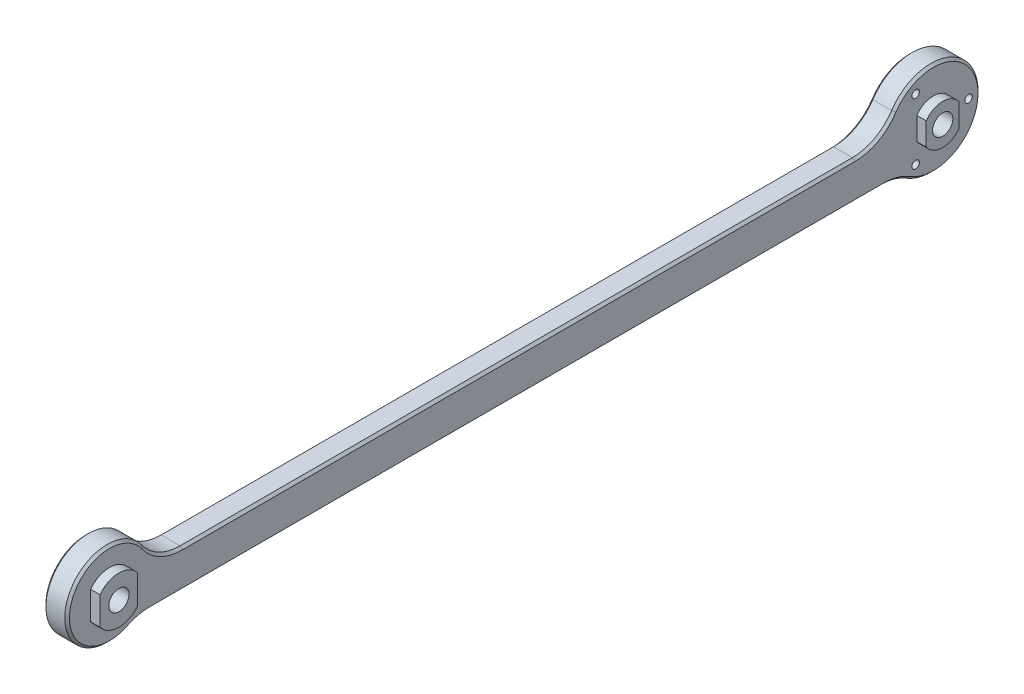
ISO-10303-21;
HEADER;
FILE_DESCRIPTION(('STEP AP214'),'2;1');
FILE_NAME('part.step','',(''),(''),'','','');
FILE_SCHEMA(('AUTOMOTIVE_DESIGN { 1 0 10303 214 1 1 1 1 }'));
ENDSEC;
DATA;
#1=APPLICATION_CONTEXT('core data for automotive mechanical design processes');
#2=APPLICATION_PROTOCOL_DEFINITION('international standard','automotive_design',2000,#1);
#3=PRODUCT_CONTEXT('',#1,'mechanical');
#4=PRODUCT('Part','Part','',(#3));
#5=PRODUCT_RELATED_PRODUCT_CATEGORY('part','',(#4));
#6=PRODUCT_DEFINITION_FORMATION('','',#4);
#7=PRODUCT_DEFINITION_CONTEXT('part definition',#1,'design');
#8=PRODUCT_DEFINITION('design','',#6,#7);
#9=PRODUCT_DEFINITION_SHAPE('','',#8);
#10=(LENGTH_UNIT() NAMED_UNIT(*) SI_UNIT(.MILLI.,.METRE.));
#11=(NAMED_UNIT(*) PLANE_ANGLE_UNIT() SI_UNIT($,.RADIAN.));
#12=(NAMED_UNIT(*) SI_UNIT($,.STERADIAN.) SOLID_ANGLE_UNIT());
#13=UNCERTAINTY_MEASURE_WITH_UNIT(LENGTH_MEASURE(1.E-05),#10,'distance_accuracy_value','');
#14=(GEOMETRIC_REPRESENTATION_CONTEXT(3) GLOBAL_UNCERTAINTY_ASSIGNED_CONTEXT((#13)) GLOBAL_UNIT_ASSIGNED_CONTEXT((#10,
#11,#12)) REPRESENTATION_CONTEXT('',''));
#15=CARTESIAN_POINT('',(0.,0.,0.));
#16=DIRECTION('',(0.,0.,1.));
#17=DIRECTION('',(1.,0.,0.));
#18=AXIS2_PLACEMENT_3D('',#15,#16,#17);
#19=CARTESIAN_POINT('',(7.,0.,0.));
#20=DIRECTION('',(1.,0.,0.));
#21=DIRECTION('',(0.,0.,-1.));
#22=AXIS2_PLACEMENT_3D('',#19,#20,#21);
#23=PLANE('',#22);
#24=CARTESIAN_POINT('',(7.,0.,0.));
#25=DIRECTION('',(1.,0.,0.));
#26=DIRECTION('',(0.,0.,-1.));
#27=AXIS2_PLACEMENT_3D('',#24,#25,#26);
#28=CIRCLE('',#27,2.15);
#29=CARTESIAN_POINT('',(7.,0.,-2.15));
#30=VERTEX_POINT('',#29);
#31=EDGE_CURVE('P0_E400',#30,#30,#28,.F.);
#32=ORIENTED_EDGE('',*,*,#31,.T.);
#33=EDGE_LOOP('',(#32));
#34=FACE_BOUND('',#33,.T.);
#35=CARTESIAN_POINT('',(7.,0.,0.));
#36=DIRECTION('',(1.,0.,0.));
#37=DIRECTION('',(0.,0.,-1.));
#38=AXIS2_PLACEMENT_3D('',#35,#36,#37);
#39=CIRCLE('',#38,4.25);
#40=CARTESIAN_POINT('',(7.,-2.41091269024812,-3.5));
#41=VERTEX_POINT('',#40);
#42=CARTESIAN_POINT('',(7.,-2.41091269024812,3.5));
#43=VERTEX_POINT('',#42);
#44=EDGE_CURVE('P0_E19',#41,#43,#39,.F.);
#45=ORIENTED_EDGE('',*,*,#44,.F.);
#46=DIRECTION('',(0.,1.,0.));
#47=VECTOR('',#46,1.);
#48=CARTESIAN_POINT('',(7.,-2.410912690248,-3.5));
#49=LINE('',#48,#47);
#50=CARTESIAN_POINT('',(7.,2.41091269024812,-3.5));
#51=VERTEX_POINT('',#50);
#52=EDGE_CURVE('P0_E129',#51,#41,#49,.F.);
#53=ORIENTED_EDGE('',*,*,#52,.F.);
#54=CARTESIAN_POINT('',(7.,0.,0.));
#55=DIRECTION('',(1.,0.,0.));
#56=DIRECTION('',(0.,0.,-1.));
#57=AXIS2_PLACEMENT_3D('',#54,#55,#56);
#58=CIRCLE('',#57,4.25);
#59=CARTESIAN_POINT('',(7.,2.41091269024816,3.50000000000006));
#60=VERTEX_POINT('',#59);
#61=EDGE_CURVE('P0_E163',#60,#51,#58,.F.);
#62=ORIENTED_EDGE('',*,*,#61,.F.);
#63=DIRECTION('',(0.,1.,0.));
#64=VECTOR('',#63,1.);
#65=CARTESIAN_POINT('',(7.,2.410912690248,3.5));
#66=LINE('',#65,#64);
#67=EDGE_CURVE('P0_E143',#43,#60,#66,.T.);
#68=ORIENTED_EDGE('',*,*,#67,.F.);
#69=EDGE_LOOP('',(#45,#53,#62,#68));
#70=FACE_BOUND('',#69,.T.);
#71=ADVANCED_FACE('P0_F16',(#34,#70),#23,.T.);
#72=CARTESIAN_POINT('',(7.,0.,0.));
#73=DIRECTION('',(1.,0.,0.));
#74=DIRECTION('',(0.,0.,-1.));
#75=AXIS2_PLACEMENT_3D('',#72,#73,#74);
#76=PLANE('',#75);
#77=CARTESIAN_POINT('',(7.,0.,175.));
#78=DIRECTION('',(1.,0.,0.));
#79=DIRECTION('',(0.,0.,-1.));
#80=AXIS2_PLACEMENT_3D('',#77,#78,#79);
#81=CIRCLE('',#80,2.15);
#82=CARTESIAN_POINT('',(7.,0.,172.85));
#83=VERTEX_POINT('',#82);
#84=EDGE_CURVE('P0_E275',#83,#83,#81,.F.);
#85=ORIENTED_EDGE('',*,*,#84,.T.);
#86=EDGE_LOOP('',(#85));
#87=FACE_BOUND('',#86,.T.);
#88=CARTESIAN_POINT('',(7.,0.,175.));
#89=DIRECTION('',(1.,0.,0.));
#90=DIRECTION('',(0.,0.,-1.));
#91=AXIS2_PLACEMENT_3D('',#88,#89,#90);
#92=CIRCLE('',#91,5.);
#93=CARTESIAN_POINT('',(7.,-3.,171.));
#94=VERTEX_POINT('',#93);
#95=CARTESIAN_POINT('',(7.,-3.00000000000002,179.));
#96=VERTEX_POINT('',#95);
#97=EDGE_CURVE('P0_E404',#94,#96,#92,.F.);
#98=ORIENTED_EDGE('',*,*,#97,.F.);
#99=DIRECTION('',(0.,1.,0.));
#100=VECTOR('',#99,1.);
#101=CARTESIAN_POINT('',(7.,-3.,171.));
#102=LINE('',#101,#100);
#103=CARTESIAN_POINT('',(7.,3.,171.));
#104=VERTEX_POINT('',#103);
#105=EDGE_CURVE('P0_E312',#104,#94,#102,.F.);
#106=ORIENTED_EDGE('',*,*,#105,.F.);
#107=CARTESIAN_POINT('',(7.,0.,175.));
#108=DIRECTION('',(1.,0.,0.));
#109=DIRECTION('',(0.,0.,-1.));
#110=AXIS2_PLACEMENT_3D('',#107,#108,#109);
#111=CIRCLE('',#110,5.);
#112=CARTESIAN_POINT('',(7.,3.00000000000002,179.));
#113=VERTEX_POINT('',#112);
#114=EDGE_CURVE('P0_E406',#113,#104,#111,.F.);
#115=ORIENTED_EDGE('',*,*,#114,.F.);
#116=DIRECTION('',(0.,1.,0.));
#117=VECTOR('',#116,1.);
#118=CARTESIAN_POINT('',(7.,3.,179.));
#119=LINE('',#118,#117);
#120=EDGE_CURVE('P0_E152',#96,#113,#119,.T.);
#121=ORIENTED_EDGE('',*,*,#120,.F.);
#122=EDGE_LOOP('',(#98,#106,#115,#121));
#123=FACE_BOUND('',#122,.T.);
#124=ADVANCED_FACE('P0_F516',(#87,#123),#76,.T.);
#125=CARTESIAN_POINT('',(5.00000000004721,11.,159.5080666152));
#126=DIRECTION('',(1.,0.,0.));
#127=DIRECTION('',(0.,0.,-1.));
#128=AXIS2_PLACEMENT_3D('',#125,#126,#127);
#129=CONICAL_SURFACE('',#128,10.5000000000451,0.785398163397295);
#130=DIRECTION('',(-0.707106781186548,0.707106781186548,0.));
#131=VECTOR('',#130,1.);
#132=CARTESIAN_POINT('',(4.75,0.75,159.508066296));
#133=LINE('',#132,#131);
#134=CARTESIAN_POINT('',(4.4999999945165,1.00000000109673,159.508066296));
#135=VERTEX_POINT('',#134);
#136=CARTESIAN_POINT('',(4.99999999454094,0.5000000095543,159.5080664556));
#137=VERTEX_POINT('',#136);
#138=EDGE_CURVE('P0_E167',#135,#137,#133,.F.);
#139=ORIENTED_EDGE('',*,*,#138,.F.);
#140=CARTESIAN_POINT('',(4.499999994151,11.,159.5080666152));
#141=DIRECTION('',(-1.,0.,0.));
#142=DIRECTION('',(0.,0.,1.));
#143=AXIS2_PLACEMENT_3D('',#140,#141,#142);
#144=CIRCLE('',#143,10.);
#145=CARTESIAN_POINT('',(4.49999999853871,5.21052655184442,167.661715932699));
#146=VERTEX_POINT('',#145);
#147=EDGE_CURVE('P0_E283',#135,#146,#144,.T.);
#148=ORIENTED_EDGE('',*,*,#147,.T.);
#149=CARTESIAN_POINT('',(5.00000000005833,4.92105282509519,168.069398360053));
#150=CARTESIAN_POINT('',(4.97916666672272,4.93311423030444,168.052411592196));
#151=CARTESIAN_POINT('',(4.95833333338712,4.94517563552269,168.035424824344));
#152=CARTESIAN_POINT('',(4.91666666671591,4.96929844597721,168.001451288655));
#153=CARTESIAN_POINT('',(4.89583333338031,4.98135985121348,167.984464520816));
#154=CARTESIAN_POINT('',(4.85416666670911,5.00548266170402,167.950490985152));
#155=CARTESIAN_POINT('',(4.8333333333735,5.01754406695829,167.933504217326));
#156=CARTESIAN_POINT('',(4.79166666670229,5.04166687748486,167.899530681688));
#157=CARTESIAN_POINT('',(4.77083333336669,5.05372828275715,167.882543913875));
#158=CARTESIAN_POINT('',(4.72916666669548,5.07785109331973,167.848570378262));
#159=CARTESIAN_POINT('',(4.70833333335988,5.08991249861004,167.831583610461));
#160=CARTESIAN_POINT('',(4.66666666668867,5.11403530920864,167.797610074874));
#161=CARTESIAN_POINT('',(4.64583333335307,5.12609671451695,167.780623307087));
#162=CARTESIAN_POINT('',(4.60416666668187,5.15021952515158,167.746649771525));
#163=CARTESIAN_POINT('',(4.58333333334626,5.16228093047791,167.72966300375));
#164=CARTESIAN_POINT('',(4.54166666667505,5.18640374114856,167.695689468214));
#165=CARTESIAN_POINT('',(4.52083333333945,5.1984651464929,167.678702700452));
#166=CARTESIAN_POINT('',(4.50000000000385,5.21052655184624,167.661715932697));
#167=B_SPLINE_CURVE_WITH_KNOTS('',3,(#149,#150,#151,#152,#153,#154,#155,#156,#157,#158,#159,
#160,#161,#162,#163,#164,#165,#166),.UNSPECIFIED.,.F.,.F.,(4,2,2,2,2,2,2,2,4),(0.,
0.088388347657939,0.176776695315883,0.265165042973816,0.353553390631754,0.441941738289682,
0.530330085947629,0.618718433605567,0.707106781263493),.UNSPECIFIED.);
#168=CARTESIAN_POINT('',(4.99999999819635,4.92105273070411,168.069398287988));
#169=VERTEX_POINT('',#168);
#170=EDGE_CURVE('P0_E250',#169,#146,#167,.T.);
#171=ORIENTED_EDGE('',*,*,#170,.F.);
#172=CARTESIAN_POINT('',(4.99999999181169,11.,159.5080666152));
#173=DIRECTION('',(1.,0.,0.));
#174=DIRECTION('',(0.,0.,-1.));
#175=AXIS2_PLACEMENT_3D('',#172,#173,#174);
#176=CIRCLE('',#175,10.4999999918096);
#177=EDGE_CURVE('P0_E394',#137,#169,#176,.F.);
#178=ORIENTED_EDGE('',*,*,#177,.F.);
#179=EDGE_LOOP('',(#139,#148,#171,#178));
#180=FACE_BOUND('',#179,.T.);
#181=ADVANCED_FACE('P0_F559',(#180),#129,.F.);
#182=CARTESIAN_POINT('',(4.49999999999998,0.,175.));
#183=DIRECTION('',(-1.,0.,0.));
#184=DIRECTION('',(0.,0.,1.));
#185=AXIS2_PLACEMENT_3D('',#182,#183,#184);
#186=CONICAL_SURFACE('',#185,8.99999999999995,0.785398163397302);
#187=CARTESIAN_POINT('',(4.5,0.,175.));
#188=DIRECTION('',(1.,0.,0.));
#189=DIRECTION('',(0.,0.,-1.));
#190=AXIS2_PLACEMENT_3D('',#187,#188,#189);
#191=CIRCLE('',#190,9.);
#192=CARTESIAN_POINT('',(4.49999999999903,-8.0526315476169,170.980656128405));
#193=VERTEX_POINT('',#192);
#194=EDGE_CURVE('P0_E268',#193,#146,#191,.F.);
#195=ORIENTED_EDGE('',*,*,#194,.F.);
#196=CARTESIAN_POINT('',(4.49999999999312,-8.05263154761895,170.980656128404));
#197=CARTESIAN_POINT('',(4.52083333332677,-8.0339911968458,170.989960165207));
#198=CARTESIAN_POINT('',(4.54166666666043,-8.0153508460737,170.999264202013));
#199=CARTESIAN_POINT('',(4.58333333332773,-7.97807014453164,171.017872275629));
#200=CARTESIAN_POINT('',(4.60416666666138,-7.95942979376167,171.027176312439));
#201=CARTESIAN_POINT('',(4.64583333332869,-7.92214909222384,171.045784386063));
#202=CARTESIAN_POINT('',(4.66666666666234,-7.90350874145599,171.055088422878));
#203=CARTESIAN_POINT('',(4.70833333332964,-7.8662280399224,171.073696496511));
#204=CARTESIAN_POINT('',(4.7291666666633,-7.84758768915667,171.083000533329));
#205=CARTESIAN_POINT('',(4.7708333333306,-7.81030698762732,171.101608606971));
#206=CARTESIAN_POINT('',(4.79166666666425,-7.79166663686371,171.110912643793));
#207=CARTESIAN_POINT('',(4.83333333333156,-7.75438593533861,171.129520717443));
#208=CARTESIAN_POINT('',(4.85416666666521,-7.73574558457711,171.13882475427));
#209=CARTESIAN_POINT('',(4.89583333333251,-7.69846488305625,171.157432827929));
#210=CARTESIAN_POINT('',(4.91666666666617,-7.67982453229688,171.16673686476));
#211=CARTESIAN_POINT('',(4.95833333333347,-7.64254383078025,171.185344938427));
#212=CARTESIAN_POINT('',(4.97916666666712,-7.623903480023,171.194648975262));
#213=CARTESIAN_POINT('',(5.00000000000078,-7.60526312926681,171.2039530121));
#214=B_SPLINE_CURVE_WITH_KNOTS('',3,(#196,#197,#198,#199,#200,#201,#202,#203,#204,#205,#206,
#207,#208,#209,#210,#211,#212,#213),.UNSPECIFIED.,.F.,.F.,(4,2,2,2,2,2,2,2,4),(0.,
0.0883883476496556,0.176776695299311,0.265165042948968,0.353553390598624,0.441941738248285,
0.530330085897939,0.6187184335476,0.707106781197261),.UNSPECIFIED.);
#215=CARTESIAN_POINT('',(5.00000000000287,-7.60526314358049,171.203953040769));
#216=VERTEX_POINT('',#215);
#217=EDGE_CURVE('P0_E228',#193,#216,#214,.T.);
#218=ORIENTED_EDGE('',*,*,#217,.T.);
#219=CARTESIAN_POINT('',(5.00000000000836,0.,175.));
#220=DIRECTION('',(-1.,0.,0.));
#221=DIRECTION('',(0.,0.,1.));
#222=AXIS2_PLACEMENT_3D('',#219,#220,#221);
#223=CIRCLE('',#222,8.49999999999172);
#224=EDGE_CURVE('P0_E392',#169,#216,#223,.F.);
#225=ORIENTED_EDGE('',*,*,#224,.F.);
#226=ORIENTED_EDGE('',*,*,#170,.T.);
#227=EDGE_LOOP('',(#195,#218,#225,#226));
#228=FACE_BOUND('',#227,.T.);
#229=ADVANCED_FACE('P0_F254',(#228),#186,.T.);
#230=CARTESIAN_POINT('',(5.00000000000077,-17.,166.5147186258));
#231=DIRECTION('',(1.,0.,0.));
#232=DIRECTION('',(0.,0.,-1.));
#233=AXIS2_PLACEMENT_3D('',#230,#231,#232);
#234=CONICAL_SURFACE('',#233,10.4999999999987,0.785398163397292);
#235=DIRECTION('',(0.707106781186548,0.707106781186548,0.));
#236=VECTOR('',#235,1.);
#237=CARTESIAN_POINT('',(4.75,-6.75,166.5147186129));
#238=LINE('',#237,#236);
#239=CARTESIAN_POINT('',(5.00000000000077,-6.50000000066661,166.51471861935));
#240=VERTEX_POINT('',#239);
#241=CARTESIAN_POINT('',(4.499999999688,-7.000000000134,166.51471860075));
#242=VERTEX_POINT('',#241);
#243=EDGE_CURVE('P0_E220',#240,#242,#238,.F.);
#244=ORIENTED_EDGE('',*,*,#243,.F.);
#245=CARTESIAN_POINT('',(5.00000000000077,-17.,166.5147186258));
#246=DIRECTION('',(1.,0.,0.));
#247=DIRECTION('',(0.,0.,-1.));
#248=AXIS2_PLACEMENT_3D('',#245,#246,#247);
#249=CIRCLE('',#248,10.4999999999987);
#250=EDGE_CURVE('P0_E390',#216,#240,#249,.F.);
#251=ORIENTED_EDGE('',*,*,#250,.F.);
#252=ORIENTED_EDGE('',*,*,#217,.F.);
#253=CARTESIAN_POINT('',(4.500000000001,-17.,166.5147186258));
#254=DIRECTION('',(-1.,0.,0.));
#255=DIRECTION('',(0.,0.,1.));
#256=AXIS2_PLACEMENT_3D('',#253,#254,#255);
#257=CIRCLE('',#256,10.);
#258=EDGE_CURVE('P0_E259',#193,#242,#257,.T.);
#259=ORIENTED_EDGE('',*,*,#258,.T.);
#260=EDGE_LOOP('',(#244,#251,#252,#259));
#261=FACE_BOUND('',#260,.T.);
#262=ADVANCED_FACE('P0_F238',(#261),#234,.F.);
#263=CARTESIAN_POINT('',(4.75,-6.75,88.52518618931));
#264=DIRECTION('',(0.707106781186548,-0.707106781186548,0.));
#265=DIRECTION('',(0.707106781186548,0.707106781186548,0.));
#266=AXIS2_PLACEMENT_3D('',#263,#264,#265);
#267=PLANE('',#266);
#268=ORIENTED_EDGE('',*,*,#243,.T.);
#269=DIRECTION('',(0.,0.,1.));
#270=VECTOR('',#269,1.);
#271=CARTESIAN_POINT('',(4.499999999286,-7.,7.141428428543));
#272=LINE('',#271,#270);
#273=CARTESIAN_POINT('',(4.49999999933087,-7.00000000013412,10.5356538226));
#274=VERTEX_POINT('',#273);
#275=EDGE_CURVE('P0_E271',#242,#274,#272,.F.);
#276=ORIENTED_EDGE('',*,*,#275,.T.);
#277=CARTESIAN_POINT('',(4.49999999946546,-7.00000000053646,10.5356538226));
#278=CARTESIAN_POINT('',(4.52083333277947,-6.97916666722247,10.5356538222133));
#279=CARTESIAN_POINT('',(4.54166666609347,-6.95833333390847,10.5356538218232));
#280=CARTESIAN_POINT('',(4.58333333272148,-6.91666666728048,10.5356538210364));
#281=CARTESIAN_POINT('',(4.60416666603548,-6.89583333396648,10.5356538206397));
#282=CARTESIAN_POINT('',(4.64583333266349,-6.85416666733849,10.5356538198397));
#283=CARTESIAN_POINT('',(4.66666666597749,-6.83333333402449,10.5356538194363));
#284=CARTESIAN_POINT('',(4.70833333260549,-6.79166666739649,10.535653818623));
#285=CARTESIAN_POINT('',(4.7291666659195,-6.7708333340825,10.5356538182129));
#286=CARTESIAN_POINT('',(4.7708333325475,-6.7291666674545,10.5356538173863));
#287=CARTESIAN_POINT('',(4.79166666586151,-6.70833333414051,10.5356538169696));
#288=CARTESIAN_POINT('',(4.83333333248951,-6.66666666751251,10.5356538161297));
#289=CARTESIAN_POINT('',(4.85416666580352,-6.64583333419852,10.5356538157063));
#290=CARTESIAN_POINT('',(4.89583333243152,-6.60416666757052,10.5356538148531));
#291=CARTESIAN_POINT('',(4.91666666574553,-6.58333333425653,10.5356538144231));
#292=CARTESIAN_POINT('',(4.95833333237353,-6.54166666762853,10.5356538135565));
#293=CARTESIAN_POINT('',(4.97916666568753,-6.52083333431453,10.5356538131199));
#294=CARTESIAN_POINT('',(4.99999999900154,-6.50000000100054,10.53565381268));
#295=B_SPLINE_CURVE_WITH_KNOTS('',3,(#277,#278,#279,#280,#281,#282,#283,#284,#285,#286,#287,
#288,#289,#290,#291,#292,#293,#294),.UNSPECIFIED.,.F.,.F.,(4,2,2,2,2,2,2,2,4),(0.,
0.0883883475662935,0.176776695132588,0.265165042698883,0.353553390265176,0.44194173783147,
0.530330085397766,0.618718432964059,0.707106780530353),.UNSPECIFIED.);
#296=CARTESIAN_POINT('',(4.99999999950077,-6.5000000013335,10.535653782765));
#297=VERTEX_POINT('',#296);
#298=EDGE_CURVE('P0_E211',#274,#297,#295,.T.);
#299=ORIENTED_EDGE('',*,*,#298,.T.);
#300=DIRECTION('',(0.,0.,-1.));
#301=VECTOR('',#300,1.);
#302=CARTESIAN_POINT('',(5.,-6.500000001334,0.));
#303=LINE('',#302,#301);
#304=EDGE_CURVE('P0_E389',#240,#297,#303,.T.);
#305=ORIENTED_EDGE('',*,*,#304,.F.);
#306=EDGE_LOOP('',(#268,#276,#299,#305));
#307=FACE_BOUND('',#306,.T.);
#308=ADVANCED_FACE('P0_F237',(#307),#267,.T.);
#309=CARTESIAN_POINT('',(5.00000000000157,-17.,10.53565375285));
#310=DIRECTION('',(1.,0.,0.));
#311=DIRECTION('',(0.,1.,0.));
#312=AXIS2_PLACEMENT_3D('',#309,#310,#311);
#313=CONICAL_SURFACE('',#312,10.4999999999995,0.7853981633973);
#314=CARTESIAN_POINT('',(4.99999999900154,-17.,10.53565375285));
#315=DIRECTION('',(1.,0.,0.));
#316=DIRECTION('',(0.,1.,0.));
#317=AXIS2_PLACEMENT_3D('',#314,#315,#316);
#318=CIRCLE('',#317,10.4999999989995);
#319=CARTESIAN_POINT('',(4.99999999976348,-8.07499999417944,5.00443554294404));
#320=VERTEX_POINT('',#319);
#321=EDGE_CURVE('P0_E386',#297,#320,#318,.F.);
#322=ORIENTED_EDGE('',*,*,#321,.F.);
#323=ORIENTED_EDGE('',*,*,#298,.F.);
#324=CARTESIAN_POINT('',(4.499999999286,-17.,10.53565375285));
#325=DIRECTION('',(-1.,0.,0.));
#326=DIRECTION('',(0.,0.,1.));
#327=AXIS2_PLACEMENT_3D('',#324,#325,#326);
#328=CIRCLE('',#327,10.);
#329=CARTESIAN_POINT('',(4.4999999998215,-8.49999998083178,5.26782690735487));
#330=VERTEX_POINT('',#329);
#331=EDGE_CURVE('P0_E274',#274,#330,#328,.T.);
#332=ORIENTED_EDGE('',*,*,#331,.T.);
#333=CARTESIAN_POINT('',(5.00000000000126,-8.07499998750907,5.00443555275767));
#334=CARTESIAN_POINT('',(4.97916666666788,-8.09270832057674,5.01541019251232));
#335=CARTESIAN_POINT('',(4.95833333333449,-8.11041665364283,5.0263848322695));
#336=CARTESIAN_POINT('',(4.91666666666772,-8.1458333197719,5.04833411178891));
#337=CARTESIAN_POINT('',(4.89583333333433,-8.16354165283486,5.05930875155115));
#338=CARTESIAN_POINT('',(4.85416666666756,-8.19895831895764,5.08125803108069));
#339=CARTESIAN_POINT('',(4.83333333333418,-8.21666665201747,5.092232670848));
#340=CARTESIAN_POINT('',(4.79166666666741,-8.25208331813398,5.11418195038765));
#341=CARTESIAN_POINT('',(4.77083333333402,-8.26979165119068,5.12515659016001));
#342=CARTESIAN_POINT('',(4.72916666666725,-8.30520831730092,5.14710586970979));
#343=CARTESIAN_POINT('',(4.70833333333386,-8.32291665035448,5.15808050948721));
#344=CARTESIAN_POINT('',(4.66666666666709,-8.35833331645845,5.18002978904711));
#345=CARTESIAN_POINT('',(4.64583333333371,-8.37604164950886,5.19100442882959));
#346=CARTESIAN_POINT('',(4.60416666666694,-8.41145831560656,5.2129537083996));
#347=CARTESIAN_POINT('',(4.58333333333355,-8.42916664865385,5.22392834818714));
#348=CARTESIAN_POINT('',(4.54166666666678,-8.46458331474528,5.24587762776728));
#349=CARTESIAN_POINT('',(4.52083333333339,-8.48229164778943,5.25685226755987));
#350=CARTESIAN_POINT('',(4.5,-8.499999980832,5.267826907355));
#351=B_SPLINE_CURVE_WITH_KNOTS('',3,(#333,#334,#335,#336,#337,#338,#339,#340,#341,#342,#343,
#344,#345,#346,#347,#348,#349,#350),.UNSPECIFIED.,.F.,.F.,(4,2,2,2,2,2,2,2,4),(0.,
0.0883883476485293,0.176776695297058,0.265165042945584,0.353553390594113,0.441941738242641,
0.530330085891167,0.618718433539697,0.707106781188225),.UNSPECIFIED.);
#352=EDGE_CURVE('P0_E195',#320,#330,#351,.T.);
#353=ORIENTED_EDGE('',*,*,#352,.F.);
#354=EDGE_LOOP('',(#322,#323,#332,#353));
#355=FACE_BOUND('',#354,.T.);
#356=ADVANCED_FACE('P0_F215',(#355),#313,.F.);
#357=CARTESIAN_POINT('',(4.49999999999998,0.,0.));
#358=DIRECTION('',(-1.,0.,0.));
#359=DIRECTION('',(0.,0.,1.));
#360=AXIS2_PLACEMENT_3D('',#357,#358,#359);
#361=CONICAL_SURFACE('',#360,9.99999999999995,0.7853981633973);
#362=CARTESIAN_POINT('',(4.5,0.,0.));
#363=DIRECTION('',(1.,0.,0.));
#364=DIRECTION('',(0.,0.,-1.));
#365=AXIS2_PLACEMENT_3D('',#362,#363,#364);
#366=CIRCLE('',#365,10.);
#367=CARTESIAN_POINT('',(4.50000000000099,5.49999999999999,8.35164654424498));
#368=VERTEX_POINT('',#367);
#369=EDGE_CURVE('P0_E299',#368,#330,#366,.F.);
#370=ORIENTED_EDGE('',*,*,#369,.F.);
#371=CARTESIAN_POINT('',(4.50000000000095,5.49999999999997,8.35164654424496));
#372=CARTESIAN_POINT('',(4.52083333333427,5.48854167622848,8.33424727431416));
#373=CARTESIAN_POINT('',(4.54166666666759,5.47708335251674,8.31684800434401));
#374=CARTESIAN_POINT('',(4.58333333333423,5.4541667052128,8.282049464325));
#375=CARTESIAN_POINT('',(4.60416666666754,5.44270838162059,8.26465019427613));
#376=CARTESIAN_POINT('',(4.64583333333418,5.4197917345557,8.22985165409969));
#377=CARTESIAN_POINT('',(4.6666666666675,5.40833341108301,8.21245238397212));
#378=CARTESIAN_POINT('',(4.70833333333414,5.38541676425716,8.17765384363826));
#379=CARTESIAN_POINT('',(4.72916666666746,5.373958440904,8.16025457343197));
#380=CARTESIAN_POINT('',(4.7708333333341,5.3510417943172,8.12545603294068));
#381=CARTESIAN_POINT('',(4.79166666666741,5.33958347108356,8.10805676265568));
#382=CARTESIAN_POINT('',(4.83333333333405,5.3166668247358,8.07325822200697));
#383=CARTESIAN_POINT('',(4.85416666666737,5.30520850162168,8.05585895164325));
#384=CARTESIAN_POINT('',(4.89583333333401,5.28229185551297,8.02106041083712));
#385=CARTESIAN_POINT('',(4.91666666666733,5.27083353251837,8.00366114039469));
#386=CARTESIAN_POINT('',(4.95833333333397,5.24791688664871,7.96886259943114));
#387=CARTESIAN_POINT('',(4.97916666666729,5.23645856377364,7.95146332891));
#388=CARTESIAN_POINT('',(5.0000000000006,5.22500024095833,7.93406405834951));
#389=B_SPLINE_CURVE_WITH_KNOTS('',3,(#371,#372,#373,#374,#375,#376,#377,#378,#379,#380,#381,
#382,#383,#384,#385,#386,#387,#388),.UNSPECIFIED.,.F.,.F.,(4,2,2,2,2,2,2,2,4),(0.,
0.0883883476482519,0.176776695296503,0.265165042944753,0.353553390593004,0.441941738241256,
0.530330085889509,0.618718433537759,0.70710678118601),.UNSPECIFIED.);
#390=CARTESIAN_POINT('',(5.00000000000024,5.22500012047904,7.93406413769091));
#391=VERTEX_POINT('',#390);
#392=EDGE_CURVE('P0_E171',#368,#391,#389,.T.);
#393=ORIENTED_EDGE('',*,*,#392,.T.);
#394=CARTESIAN_POINT('',(5.00000000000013,0.,0.));
#395=DIRECTION('',(-1.,0.,0.));
#396=DIRECTION('',(0.,0.,1.));
#397=AXIS2_PLACEMENT_3D('',#394,#395,#396);
#398=CIRCLE('',#397,9.49999999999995);
#399=EDGE_CURVE('P0_E384',#320,#391,#398,.F.);
#400=ORIENTED_EDGE('',*,*,#399,.F.);
#401=ORIENTED_EDGE('',*,*,#352,.T.);
#402=EDGE_LOOP('',(#370,#393,#400,#401));
#403=FACE_BOUND('',#402,.T.);
#404=ADVANCED_FACE('P0_F199',(#403),#361,.T.);
#405=CARTESIAN_POINT('',(5.0000000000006,11.,16.70329308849));
#406=DIRECTION('',(1.,0.,0.));
#407=DIRECTION('',(0.,0.,-1.));
#408=AXIS2_PLACEMENT_3D('',#405,#406,#407);
#409=CONICAL_SURFACE('',#408,10.4999999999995,0.785398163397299);
#410=CARTESIAN_POINT('',(5.0000000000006,11.,16.70329308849));
#411=DIRECTION('',(1.,0.,0.));
#412=DIRECTION('',(0.,0.,-1.));
#413=AXIS2_PLACEMENT_3D('',#410,#411,#412);
#414=CIRCLE('',#413,10.4999999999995);
#415=CARTESIAN_POINT('',(5.0000000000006,0.500000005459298,16.7032932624));
#416=VERTEX_POINT('',#415);
#417=EDGE_CURVE('P0_E382',#391,#416,#414,.F.);
#418=ORIENTED_EDGE('',*,*,#417,.F.);
#419=ORIENTED_EDGE('',*,*,#392,.F.);
#420=CARTESIAN_POINT('',(4.500000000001,11.,16.70329308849));
#421=DIRECTION('',(-1.,0.,0.));
#422=DIRECTION('',(0.,0.,1.));
#423=AXIS2_PLACEMENT_3D('',#420,#421,#422);
#424=CIRCLE('',#423,10.);
#425=CARTESIAN_POINT('',(4.499999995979,1.0000000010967,16.703293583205));
#426=VERTEX_POINT('',#425);
#427=EDGE_CURVE('P0_E296',#368,#426,#424,.T.);
#428=ORIENTED_EDGE('',*,*,#427,.T.);
#429=DIRECTION('',(-0.707106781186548,0.707106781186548,0.));
#430=VECTOR('',#429,1.);
#431=CARTESIAN_POINT('',(4.75,0.75,16.70329343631));
#432=LINE('',#431,#430);
#433=EDGE_CURVE('P0_E148',#416,#426,#432,.T.);
#434=ORIENTED_EDGE('',*,*,#433,.F.);
#435=EDGE_LOOP('',(#418,#419,#428,#434));
#436=FACE_BOUND('',#435,.T.);
#437=ADVANCED_FACE('P0_F183',(#436),#409,.F.);
#438=CARTESIAN_POINT('',(4.75,0.75,88.10567985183));
#439=DIRECTION('',(0.707106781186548,0.707106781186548,0.));
#440=DIRECTION('',(-0.707106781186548,0.707106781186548,0.));
#441=AXIS2_PLACEMENT_3D('',#438,#439,#440);
#442=PLANE('',#441);
#443=ORIENTED_EDGE('',*,*,#433,.T.);
#444=DIRECTION('',(0.,0.,-1.));
#445=VECTOR('',#444,1.);
#446=CARTESIAN_POINT('',(4.499999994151,0.9999999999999,166.05572809));
#447=LINE('',#446,#445);
#448=EDGE_CURVE('P0_E290',#426,#135,#447,.F.);
#449=ORIENTED_EDGE('',*,*,#448,.T.);
#450=ORIENTED_EDGE('',*,*,#138,.T.);
#451=DIRECTION('',(0.,0.,-1.));
#452=VECTOR('',#451,1.);
#453=CARTESIAN_POINT('',(5.,0.5000000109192,0.));
#454=LINE('',#453,#452);
#455=EDGE_CURVE('P0_E381',#416,#137,#454,.F.);
#456=ORIENTED_EDGE('',*,*,#455,.F.);
#457=EDGE_LOOP('',(#443,#449,#450,#456));
#458=FACE_BOUND('',#457,.T.);
#459=ADVANCED_FACE('P0_F181',(#458),#442,.T.);
#460=CARTESIAN_POINT('',(5.,0.,0.));
#461=DIRECTION('',(1.,0.,0.));
#462=DIRECTION('',(0.,0.,-1.));
#463=AXIS2_PLACEMENT_3D('',#460,#461,#462);
#464=CYLINDRICAL_SURFACE('',#463,4.25);
#465=DIRECTION('',(1.,0.,0.));
#466=VECTOR('',#465,1.);
#467=CARTESIAN_POINT('',(5.,-2.410912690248,3.5));
#468=LINE('',#467,#466);
#469=CARTESIAN_POINT('',(5.,-2.41091269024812,3.5));
#470=VERTEX_POINT('',#469);
#471=EDGE_CURVE('P0_E147',#470,#43,#468,.T.);
#472=ORIENTED_EDGE('',*,*,#471,.F.);
#473=CARTESIAN_POINT('',(5.,0.,0.));
#474=DIRECTION('',(1.,0.,0.));
#475=DIRECTION('',(0.,0.,-1.));
#476=AXIS2_PLACEMENT_3D('',#473,#474,#475);
#477=CIRCLE('',#476,4.25);
#478=CARTESIAN_POINT('',(5.,-2.41091269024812,-3.5));
#479=VERTEX_POINT('',#478);
#480=EDGE_CURVE('P0_E151',#479,#470,#477,.F.);
#481=ORIENTED_EDGE('',*,*,#480,.F.);
#482=DIRECTION('',(-1.,0.,0.));
#483=VECTOR('',#482,1.);
#484=CARTESIAN_POINT('',(5.,-2.410912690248,-3.5));
#485=LINE('',#484,#483);
#486=EDGE_CURVE('P0_E134',#41,#479,#485,.T.);
#487=ORIENTED_EDGE('',*,*,#486,.F.);
#488=ORIENTED_EDGE('',*,*,#44,.T.);
#489=EDGE_LOOP('',(#472,#481,#487,#488));
#490=FACE_BOUND('',#489,.T.);
#491=ADVANCED_FACE('P0_F150',(#490),#464,.T.);
#492=CARTESIAN_POINT('',(5.,2.410912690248,3.5));
#493=DIRECTION('',(0.,0.,1.));
#494=DIRECTION('',(1.,0.,0.));
#495=AXIS2_PLACEMENT_3D('',#492,#493,#494);
#496=PLANE('',#495);
#497=DIRECTION('',(1.,0.,0.));
#498=VECTOR('',#497,1.);
#499=CARTESIAN_POINT('',(5.,2.41091269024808,3.50000000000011));
#500=LINE('',#499,#498);
#501=CARTESIAN_POINT('',(5.,2.41091269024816,3.50000000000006));
#502=VERTEX_POINT('',#501);
#503=EDGE_CURVE('P0_E160',#502,#60,#500,.T.);
#504=ORIENTED_EDGE('',*,*,#503,.F.);
#505=DIRECTION('',(0.,1.,0.));
#506=VECTOR('',#505,1.);
#507=CARTESIAN_POINT('',(5.,0.,3.5));
#508=LINE('',#507,#506);
#509=EDGE_CURVE('P0_E379',#470,#502,#508,.T.);
#510=ORIENTED_EDGE('',*,*,#509,.F.);
#511=ORIENTED_EDGE('',*,*,#471,.T.);
#512=ORIENTED_EDGE('',*,*,#67,.T.);
#513=EDGE_LOOP('',(#504,#510,#511,#512));
#514=FACE_BOUND('',#513,.T.);
#515=ADVANCED_FACE('P0_F413',(#514),#496,.T.);
#516=CARTESIAN_POINT('',(5.,0.,0.));
#517=DIRECTION('',(1.,0.,0.));
#518=DIRECTION('',(0.,0.,-1.));
#519=AXIS2_PLACEMENT_3D('',#516,#517,#518);
#520=CYLINDRICAL_SURFACE('',#519,4.25);
#521=DIRECTION('',(-1.,0.,0.));
#522=VECTOR('',#521,1.);
#523=CARTESIAN_POINT('',(5.,2.410912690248,-3.5));
#524=LINE('',#523,#522);
#525=CARTESIAN_POINT('',(5.,2.41091269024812,-3.5));
#526=VERTEX_POINT('',#525);
#527=EDGE_CURVE('P0_E137',#526,#51,#524,.F.);
#528=ORIENTED_EDGE('',*,*,#527,.F.);
#529=CARTESIAN_POINT('',(5.,0.,0.));
#530=DIRECTION('',(1.,0.,0.));
#531=DIRECTION('',(0.,0.,-1.));
#532=AXIS2_PLACEMENT_3D('',#529,#530,#531);
#533=CIRCLE('',#532,4.25);
#534=EDGE_CURVE('P0_E376',#502,#526,#533,.F.);
#535=ORIENTED_EDGE('',*,*,#534,.F.);
#536=ORIENTED_EDGE('',*,*,#503,.T.);
#537=ORIENTED_EDGE('',*,*,#61,.T.);
#538=EDGE_LOOP('',(#528,#535,#536,#537));
#539=FACE_BOUND('',#538,.T.);
#540=ADVANCED_FACE('P0_F408',(#539),#520,.T.);
#541=CARTESIAN_POINT('',(5.,-2.410912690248,-3.5));
#542=DIRECTION('',(0.,0.,-1.));
#543=DIRECTION('',(-1.,0.,0.));
#544=AXIS2_PLACEMENT_3D('',#541,#542,#543);
#545=PLANE('',#544);
#546=ORIENTED_EDGE('',*,*,#486,.T.);
#547=DIRECTION('',(0.,1.,0.));
#548=VECTOR('',#547,1.);
#549=CARTESIAN_POINT('',(5.,0.,-3.5));
#550=LINE('',#549,#548);
#551=EDGE_CURVE('P0_E378',#526,#479,#550,.F.);
#552=ORIENTED_EDGE('',*,*,#551,.F.);
#553=ORIENTED_EDGE('',*,*,#527,.T.);
#554=ORIENTED_EDGE('',*,*,#52,.T.);
#555=EDGE_LOOP('',(#546,#552,#553,#554));
#556=FACE_BOUND('',#555,.T.);
#557=ADVANCED_FACE('P0_F131',(#556),#545,.T.);
#558=CARTESIAN_POINT('',(5.,3.,179.));
#559=DIRECTION('',(0.,0.,1.));
#560=DIRECTION('',(1.,0.,0.));
#561=AXIS2_PLACEMENT_3D('',#558,#559,#560);
#562=PLANE('',#561);
#563=DIRECTION('',(1.,0.,0.));
#564=VECTOR('',#563,1.);
#565=CARTESIAN_POINT('',(5.,3.00000000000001,179.));
#566=LINE('',#565,#564);
#567=CARTESIAN_POINT('',(5.,3.00000000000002,179.));
#568=VERTEX_POINT('',#567);
#569=EDGE_CURVE('P0_E155',#568,#113,#566,.T.);
#570=ORIENTED_EDGE('',*,*,#569,.F.);
#571=DIRECTION('',(0.,1.,0.));
#572=VECTOR('',#571,1.);
#573=CARTESIAN_POINT('',(5.,0.,179.));
#574=LINE('',#573,#572);
#575=CARTESIAN_POINT('',(5.,-3.00000000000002,179.));
#576=VERTEX_POINT('',#575);
#577=EDGE_CURVE('P0_E375',#576,#568,#574,.T.);
#578=ORIENTED_EDGE('',*,*,#577,.F.);
#579=DIRECTION('',(1.,0.,0.));
#580=VECTOR('',#579,1.);
#581=CARTESIAN_POINT('',(5.,-3.,179.));
#582=LINE('',#581,#580);
#583=EDGE_CURVE('P0_E403',#96,#576,#582,.F.);
#584=ORIENTED_EDGE('',*,*,#583,.F.);
#585=ORIENTED_EDGE('',*,*,#120,.T.);
#586=EDGE_LOOP('',(#570,#578,#584,#585));
#587=FACE_BOUND('',#586,.T.);
#588=ADVANCED_FACE('P0_F512',(#587),#562,.T.);
#589=CARTESIAN_POINT('',(5.,0.,175.));
#590=DIRECTION('',(1.,0.,0.));
#591=DIRECTION('',(0.,0.,-1.));
#592=AXIS2_PLACEMENT_3D('',#589,#590,#591);
#593=CYLINDRICAL_SURFACE('',#592,5.);
#594=CARTESIAN_POINT('',(5.,0.,175.));
#595=DIRECTION('',(1.,0.,0.));
#596=DIRECTION('',(0.,0.,-1.));
#597=AXIS2_PLACEMENT_3D('',#594,#595,#596);
#598=CIRCLE('',#597,5.);
#599=CARTESIAN_POINT('',(5.,3.,171.));
#600=VERTEX_POINT('',#599);
#601=EDGE_CURVE('P0_E373',#568,#600,#598,.F.);
#602=ORIENTED_EDGE('',*,*,#601,.F.);
#603=ORIENTED_EDGE('',*,*,#569,.T.);
#604=ORIENTED_EDGE('',*,*,#114,.T.);
#605=DIRECTION('',(-1.,0.,0.));
#606=VECTOR('',#605,1.);
#607=CARTESIAN_POINT('',(5.,3.,171.));
#608=LINE('',#607,#606);
#609=EDGE_CURVE('P0_E315',#600,#104,#608,.F.);
#610=ORIENTED_EDGE('',*,*,#609,.F.);
#611=EDGE_LOOP('',(#602,#603,#604,#610));
#612=FACE_BOUND('',#611,.T.);
#613=ADVANCED_FACE('P0_F507',(#612),#593,.T.);
#614=CARTESIAN_POINT('',(5.,-3.,171.));
#615=DIRECTION('',(0.,0.,-1.));
#616=DIRECTION('',(-1.,0.,0.));
#617=AXIS2_PLACEMENT_3D('',#614,#615,#616);
#618=PLANE('',#617);
#619=DIRECTION('',(1.,0.,0.));
#620=VECTOR('',#619,1.);
#621=CARTESIAN_POINT('',(5.,-3.,171.));
#622=LINE('',#621,#620);
#623=CARTESIAN_POINT('',(5.,-3.,171.));
#624=VERTEX_POINT('',#623);
#625=EDGE_CURVE('P0_E314',#624,#94,#622,.T.);
#626=ORIENTED_EDGE('',*,*,#625,.F.);
#627=DIRECTION('',(0.,1.,0.));
#628=VECTOR('',#627,1.);
#629=CARTESIAN_POINT('',(5.,0.,171.));
#630=LINE('',#629,#628);
#631=EDGE_CURVE('P0_E372',#600,#624,#630,.F.);
#632=ORIENTED_EDGE('',*,*,#631,.F.);
#633=ORIENTED_EDGE('',*,*,#609,.T.);
#634=ORIENTED_EDGE('',*,*,#105,.T.);
#635=EDGE_LOOP('',(#626,#632,#633,#634));
#636=FACE_BOUND('',#635,.T.);
#637=ADVANCED_FACE('P0_F520',(#636),#618,.T.);
#638=CARTESIAN_POINT('',(5.,0.,175.));
#639=DIRECTION('',(1.,0.,0.));
#640=DIRECTION('',(0.,0.,-1.));
#641=AXIS2_PLACEMENT_3D('',#638,#639,#640);
#642=CYLINDRICAL_SURFACE('',#641,5.);
#643=CARTESIAN_POINT('',(5.,0.,175.));
#644=DIRECTION('',(1.,0.,0.));
#645=DIRECTION('',(0.,0.,-1.));
#646=AXIS2_PLACEMENT_3D('',#643,#644,#645);
#647=CIRCLE('',#646,5.);
#648=EDGE_CURVE('P0_E369',#624,#576,#647,.F.);
#649=ORIENTED_EDGE('',*,*,#648,.F.);
#650=ORIENTED_EDGE('',*,*,#625,.T.);
#651=ORIENTED_EDGE('',*,*,#97,.T.);
#652=ORIENTED_EDGE('',*,*,#583,.T.);
#653=EDGE_LOOP('',(#649,#650,#651,#652));
#654=FACE_BOUND('',#653,.T.);
#655=ADVANCED_FACE('P0_F523',(#654),#642,.T.);
#656=CARTESIAN_POINT('',(5.,0.,0.));
#657=DIRECTION('',(1.,0.,0.));
#658=DIRECTION('',(0.,0.,-1.));
#659=AXIS2_PLACEMENT_3D('',#656,#657,#658);
#660=CYLINDRICAL_SURFACE('',#659,2.15);
#661=CARTESIAN_POINT('',(-3.5,0.,0.));
#662=DIRECTION('',(1.,0.,0.));
#663=DIRECTION('',(0.,0.,-1.));
#664=AXIS2_PLACEMENT_3D('',#661,#662,#663);
#665=CIRCLE('',#664,2.15);
#666=CARTESIAN_POINT('',(-3.5,0.,-2.15));
#667=VERTEX_POINT('',#666);
#668=EDGE_CURVE('P0_E366',#667,#667,#665,.T.);
#669=ORIENTED_EDGE('',*,*,#668,.F.);
#670=EDGE_LOOP('',(#669));
#671=FACE_BOUND('',#670,.T.);
#672=ORIENTED_EDGE('',*,*,#31,.F.);
#673=EDGE_LOOP('',(#672));
#674=FACE_BOUND('',#673,.T.);
#675=ADVANCED_FACE('P0_F755',(#671,#674),#660,.F.);
#676=CARTESIAN_POINT('',(5.,0.,175.));
#677=DIRECTION('',(1.,0.,0.));
#678=DIRECTION('',(0.,0.,-1.));
#679=AXIS2_PLACEMENT_3D('',#676,#677,#678);
#680=CYLINDRICAL_SURFACE('',#679,2.15);
#681=CARTESIAN_POINT('',(-3.5,0.,175.));
#682=DIRECTION('',(1.,0.,0.));
#683=DIRECTION('',(0.,0.,-1.));
#684=AXIS2_PLACEMENT_3D('',#681,#682,#683);
#685=CIRCLE('',#684,2.15);
#686=CARTESIAN_POINT('',(-3.5,0.,172.85));
#687=VERTEX_POINT('',#686);
#688=EDGE_CURVE('P0_E362',#687,#687,#685,.T.);
#689=ORIENTED_EDGE('',*,*,#688,.F.);
#690=EDGE_LOOP('',(#689));
#691=FACE_BOUND('',#690,.T.);
#692=ORIENTED_EDGE('',*,*,#84,.F.);
#693=EDGE_LOOP('',(#692));
#694=FACE_BOUND('',#693,.T.);
#695=ADVANCED_FACE('P0_F752',(#691,#694),#680,.F.);
#696=CARTESIAN_POINT('',(5.,-7.,7.141428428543));
#697=DIRECTION('',(0.,1.,0.));
#698=DIRECTION('',(0.,0.,1.));
#699=AXIS2_PLACEMENT_3D('',#696,#697,#698);
#700=PLANE('',#699);
#701=DIRECTION('',(0.,0.,1.));
#702=VECTOR('',#701,1.);
#703=CARTESIAN_POINT('',(0.5000000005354,-7.0000000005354,88.52518618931));
#704=LINE('',#703,#702);
#705=CARTESIAN_POINT('',(0.500000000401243,-7.00000000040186,10.53565382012));
#706=VERTEX_POINT('',#705);
#707=CARTESIAN_POINT('',(0.500000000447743,-7.0000000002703,166.5147185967));
#708=VERTEX_POINT('',#707);
#709=EDGE_CURVE('P0_E365',#706,#708,#704,.T.);
#710=ORIENTED_EDGE('',*,*,#709,.F.);
#711=DIRECTION('',(-1.,0.,0.));
#712=VECTOR('',#711,1.);
#713=CARTESIAN_POINT('',(17.53,-7.,10.5356538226));
#714=LINE('',#713,#712);
#715=EDGE_CURVE('P0_E309',#706,#274,#714,.F.);
#716=ORIENTED_EDGE('',*,*,#715,.T.);
#717=ORIENTED_EDGE('',*,*,#275,.F.);
#718=DIRECTION('',(-1.,0.,0.));
#719=VECTOR('',#718,1.);
#720=CARTESIAN_POINT('',(17.53,-7.,166.5147185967));
#721=LINE('',#720,#719);
#722=EDGE_CURVE('P0_E267',#242,#708,#721,.T.);
#723=ORIENTED_EDGE('',*,*,#722,.T.);
#724=EDGE_LOOP('',(#710,#716,#717,#723));
#725=FACE_BOUND('',#724,.T.);
#726=ADVANCED_FACE('P0_F619',(#725),#700,.F.);
#727=CARTESIAN_POINT('',(17.53,-17.,10.53565375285));
#728=DIRECTION('',(-1.,0.,0.));
#729=DIRECTION('',(0.,0.,1.));
#730=AXIS2_PLACEMENT_3D('',#727,#728,#729);
#731=CYLINDRICAL_SURFACE('',#730,10.);
#732=CARTESIAN_POINT('',(0.500000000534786,-17.,10.53565375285));
#733=DIRECTION('',(-1.,0.,0.));
#734=DIRECTION('',(0.,0.,-1.));
#735=AXIS2_PLACEMENT_3D('',#732,#733,#734);
#736=CIRCLE('',#735,9.99999999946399);
#737=CARTESIAN_POINT('',(0.500000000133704,-8.49999998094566,5.26782690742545));
#738=VERTEX_POINT('',#737);
#739=EDGE_CURVE('P0_E424',#706,#738,#736,.T.);
#740=ORIENTED_EDGE('',*,*,#739,.T.);
#741=DIRECTION('',(1.,0.,0.));
#742=VECTOR('',#741,1.);
#743=CARTESIAN_POINT('',(0.,-8.49999998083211,5.26782690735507));
#744=LINE('',#743,#742);
#745=EDGE_CURVE('P0_E304',#330,#738,#744,.F.);
#746=ORIENTED_EDGE('',*,*,#745,.F.);
#747=ORIENTED_EDGE('',*,*,#331,.F.);
#748=ORIENTED_EDGE('',*,*,#715,.F.);
#749=EDGE_LOOP('',(#740,#746,#747,#748));
#750=FACE_BOUND('',#749,.T.);
#751=ADVANCED_FACE('P0_F745',(#750),#731,.F.);
#752=CARTESIAN_POINT('',(0.,0.,0.));
#753=DIRECTION('',(1.,0.,0.));
#754=DIRECTION('',(0.,0.,-1.));
#755=AXIS2_PLACEMENT_3D('',#752,#753,#754);
#756=CYLINDRICAL_SURFACE('',#755,10.);
#757=DIRECTION('',(-1.,0.,0.));
#758=VECTOR('',#757,1.);
#759=CARTESIAN_POINT('',(17.53,5.49999999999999,8.35164654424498));
#760=LINE('',#759,#758);
#761=CARTESIAN_POINT('',(0.500000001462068,5.50000000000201,8.35164654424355));
#762=VERTEX_POINT('',#761);
#763=EDGE_CURVE('P0_E293',#762,#368,#760,.F.);
#764=ORIENTED_EDGE('',*,*,#763,.T.);
#765=ORIENTED_EDGE('',*,*,#369,.T.);
#766=ORIENTED_EDGE('',*,*,#745,.T.);
#767=CARTESIAN_POINT('',(0.500000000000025,0.,0.));
#768=DIRECTION('',(1.,0.,0.));
#769=DIRECTION('',(0.,0.,-1.));
#770=AXIS2_PLACEMENT_3D('',#767,#768,#769);
#771=CIRCLE('',#770,9.99999999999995);
#772=EDGE_CURVE('P0_E475',#762,#738,#771,.F.);
#773=ORIENTED_EDGE('',*,*,#772,.F.);
#774=EDGE_LOOP('',(#764,#765,#766,#773));
#775=FACE_BOUND('',#774,.T.);
#776=ADVANCED_FACE('P0_F741',(#775),#756,.T.);
#777=CARTESIAN_POINT('',(17.53,11.,16.70329308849));
#778=DIRECTION('',(-1.,0.,0.));
#779=DIRECTION('',(0.,0.,1.));
#780=AXIS2_PLACEMENT_3D('',#777,#778,#779);
#781=CYLINDRICAL_SURFACE('',#780,10.);
#782=CARTESIAN_POINT('',(0.499999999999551,11.,16.70329308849));
#783=DIRECTION('',(-1.,0.,0.));
#784=DIRECTION('',(0.,0.,-1.));
#785=AXIS2_PLACEMENT_3D('',#782,#783,#784);
#786=CIRCLE('',#785,10.);
#787=CARTESIAN_POINT('',(0.500000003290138,1.00000000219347,16.70329363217));
#788=VERTEX_POINT('',#787);
#789=EDGE_CURVE('P0_E471',#762,#788,#786,.T.);
#790=ORIENTED_EDGE('',*,*,#789,.T.);
#791=DIRECTION('',(1.,0.,0.));
#792=VECTOR('',#791,1.);
#793=CARTESIAN_POINT('',(5.,0.9999999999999,16.70329363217));
#794=LINE('',#793,#792);
#795=EDGE_CURVE('P0_E287',#788,#426,#794,.T.);
#796=ORIENTED_EDGE('',*,*,#795,.T.);
#797=ORIENTED_EDGE('',*,*,#427,.F.);
#798=ORIENTED_EDGE('',*,*,#763,.F.);
#799=EDGE_LOOP('',(#790,#796,#797,#798));
#800=FACE_BOUND('',#799,.T.);
#801=ADVANCED_FACE('P0_F737',(#800),#781,.F.);
#802=CARTESIAN_POINT('',(5.,0.9999999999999,166.05572809));
#803=DIRECTION('',(0.,-1.,0.));
#804=DIRECTION('',(0.,0.,-1.));
#805=AXIS2_PLACEMENT_3D('',#802,#803,#804);
#806=PLANE('',#805);
#807=DIRECTION('',(0.,0.,1.));
#808=VECTOR('',#807,1.);
#809=CARTESIAN_POINT('',(0.500000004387,1.000000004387,88.10567985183));
#810=LINE('',#809,#808);
#811=CARTESIAN_POINT('',(0.50000000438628,1.00000000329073,159.5080663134));
#812=VERTEX_POINT('',#811);
#813=EDGE_CURVE('P0_E461',#812,#788,#810,.F.);
#814=ORIENTED_EDGE('',*,*,#813,.F.);
#815=DIRECTION('',(-1.,0.,0.));
#816=VECTOR('',#815,1.);
#817=CARTESIAN_POINT('',(17.53,1.,159.508066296));
#818=LINE('',#817,#816);
#819=EDGE_CURVE('P0_E286',#812,#135,#818,.F.);
#820=ORIENTED_EDGE('',*,*,#819,.T.);
#821=ORIENTED_EDGE('',*,*,#448,.F.);
#822=ORIENTED_EDGE('',*,*,#795,.F.);
#823=EDGE_LOOP('',(#814,#820,#821,#822));
#824=FACE_BOUND('',#823,.T.);
#825=ADVANCED_FACE('P0_F734',(#824),#806,.F.);
#826=CARTESIAN_POINT('',(17.53,11.,159.5080666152));
#827=DIRECTION('',(-1.,0.,0.));
#828=DIRECTION('',(0.,0.,1.));
#829=AXIS2_PLACEMENT_3D('',#826,#827,#828);
#830=CYLINDRICAL_SURFACE('',#829,10.);
#831=CARTESIAN_POINT('',(0.500000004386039,11.,159.5080666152));
#832=DIRECTION('',(-1.,0.,0.));
#833=DIRECTION('',(0.,0.,-1.));
#834=AXIS2_PLACEMENT_3D('',#831,#832,#833);
#835=CIRCLE('',#834,9.99999999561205);
#836=CARTESIAN_POINT('',(0.500000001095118,5.21052655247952,167.661715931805));
#837=VERTEX_POINT('',#836);
#838=EDGE_CURVE('P0_E447',#812,#837,#835,.T.);
#839=ORIENTED_EDGE('',*,*,#838,.T.);
#840=DIRECTION('',(1.,0.,0.));
#841=VECTOR('',#840,1.);
#842=CARTESIAN_POINT('',(0.,5.21052655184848,167.661715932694));
#843=LINE('',#842,#841);
#844=EDGE_CURVE('P0_E280',#146,#837,#843,.F.);
#845=ORIENTED_EDGE('',*,*,#844,.F.);
#846=ORIENTED_EDGE('',*,*,#147,.F.);
#847=ORIENTED_EDGE('',*,*,#819,.F.);
#848=EDGE_LOOP('',(#839,#845,#846,#847));
#849=FACE_BOUND('',#848,.T.);
#850=ADVANCED_FACE('P0_F566',(#849),#830,.F.);
#851=CARTESIAN_POINT('',(0.,0.,175.));
#852=DIRECTION('',(1.,0.,0.));
#853=DIRECTION('',(0.,0.,-1.));
#854=AXIS2_PLACEMENT_3D('',#851,#852,#853);
#855=CYLINDRICAL_SURFACE('',#854,9.);
#856=DIRECTION('',(-1.,0.,0.));
#857=VECTOR('',#856,1.);
#858=CARTESIAN_POINT('',(17.53,-8.05263154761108,170.980656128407));
#859=LINE('',#858,#857);
#860=CARTESIAN_POINT('',(0.500000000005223,-8.05263154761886,170.980656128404));
#861=VERTEX_POINT('',#860);
#862=EDGE_CURVE('P0_E397',#861,#193,#859,.F.);
#863=ORIENTED_EDGE('',*,*,#862,.T.);
#864=ORIENTED_EDGE('',*,*,#194,.T.);
#865=ORIENTED_EDGE('',*,*,#844,.T.);
#866=CARTESIAN_POINT('',(0.500000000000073,0.,175.));
#867=DIRECTION('',(1.,0.,0.));
#868=DIRECTION('',(0.,0.,-1.));
#869=AXIS2_PLACEMENT_3D('',#866,#867,#868);
#870=CIRCLE('',#869,9.00000000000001);
#871=EDGE_CURVE('P0_E441',#861,#837,#870,.F.);
#872=ORIENTED_EDGE('',*,*,#871,.F.);
#873=EDGE_LOOP('',(#863,#864,#865,#872));
#874=FACE_BOUND('',#873,.T.);
#875=ADVANCED_FACE('P0_F575',(#874),#855,.T.);
#876=CARTESIAN_POINT('',(17.53,-17.,166.5147186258));
#877=DIRECTION('',(-1.,0.,0.));
#878=DIRECTION('',(0.,0.,1.));
#879=AXIS2_PLACEMENT_3D('',#876,#877,#878);
#880=CYLINDRICAL_SURFACE('',#879,10.);
#881=CARTESIAN_POINT('',(0.500000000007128,-17.,166.5147186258));
#882=DIRECTION('',(-1.,0.,0.));
#883=DIRECTION('',(0.,0.,-1.));
#884=AXIS2_PLACEMENT_3D('',#881,#882,#883);
#885=CIRCLE('',#884,9.99999999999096);
#886=EDGE_CURVE('P0_E427',#861,#708,#885,.T.);
#887=ORIENTED_EDGE('',*,*,#886,.T.);
#888=ORIENTED_EDGE('',*,*,#722,.F.);
#889=ORIENTED_EDGE('',*,*,#258,.F.);
#890=ORIENTED_EDGE('',*,*,#862,.F.);
#891=EDGE_LOOP('',(#887,#888,#889,#890));
#892=FACE_BOUND('',#891,.T.);
#893=ADVANCED_FACE('P0_F536',(#892),#880,.F.);
#894=CARTESIAN_POINT('',(5.,0.,0.));
#895=DIRECTION('',(1.,0.,0.));
#896=DIRECTION('',(0.,0.,-1.));
#897=AXIS2_PLACEMENT_3D('',#894,#895,#896);
#898=PLANE('',#897);
#899=ORIENTED_EDGE('',*,*,#631,.T.);
#900=ORIENTED_EDGE('',*,*,#648,.T.);
#901=ORIENTED_EDGE('',*,*,#577,.T.);
#902=ORIENTED_EDGE('',*,*,#601,.T.);
#903=EDGE_LOOP('',(#899,#900,#901,#902));
#904=FACE_BOUND('',#903,.T.);
#905=ORIENTED_EDGE('',*,*,#534,.T.);
#906=ORIENTED_EDGE('',*,*,#551,.T.);
#907=ORIENTED_EDGE('',*,*,#480,.T.);
#908=ORIENTED_EDGE('',*,*,#509,.T.);
#909=EDGE_LOOP('',(#905,#906,#907,#908));
#910=FACE_BOUND('',#909,.T.);
#911=CARTESIAN_POINT('',(5.,-6.495190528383,3.75));
#912=DIRECTION('',(1.,0.,0.));
#913=DIRECTION('',(0.,0.,-1.));
#914=AXIS2_PLACEMENT_3D('',#911,#912,#913);
#915=CIRCLE('',#914,0.8);
#916=CARTESIAN_POINT('',(5.,-6.495190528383,2.95));
#917=VERTEX_POINT('',#916);
#918=EDGE_CURVE('P0_E352',#917,#917,#915,.F.);
#919=ORIENTED_EDGE('',*,*,#918,.T.);
#920=EDGE_LOOP('',(#919));
#921=FACE_BOUND('',#920,.T.);
#922=CARTESIAN_POINT('',(5.,6.495190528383,3.75));
#923=DIRECTION('',(1.,0.,0.));
#924=DIRECTION('',(0.,0.,-1.));
#925=AXIS2_PLACEMENT_3D('',#922,#923,#924);
#926=CIRCLE('',#925,0.8);
#927=CARTESIAN_POINT('',(5.,6.495190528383,2.95));
#928=VERTEX_POINT('',#927);
#929=EDGE_CURVE('P0_E355',#928,#928,#926,.F.);
#930=ORIENTED_EDGE('',*,*,#929,.T.);
#931=EDGE_LOOP('',(#930));
#932=FACE_BOUND('',#931,.T.);
#933=CARTESIAN_POINT('',(5.,0.,-7.5));
#934=DIRECTION('',(1.,0.,0.));
#935=DIRECTION('',(0.,0.,-1.));
#936=AXIS2_PLACEMENT_3D('',#933,#934,#935);
#937=CIRCLE('',#936,0.8);
#938=CARTESIAN_POINT('',(5.,0.,-8.3));
#939=VERTEX_POINT('',#938);
#940=EDGE_CURVE('P0_E358',#939,#939,#937,.F.);
#941=ORIENTED_EDGE('',*,*,#940,.T.);
#942=EDGE_LOOP('',(#941));
#943=FACE_BOUND('',#942,.T.);
#944=ORIENTED_EDGE('',*,*,#417,.T.);
#945=ORIENTED_EDGE('',*,*,#455,.T.);
#946=ORIENTED_EDGE('',*,*,#177,.T.);
#947=ORIENTED_EDGE('',*,*,#224,.T.);
#948=ORIENTED_EDGE('',*,*,#250,.T.);
#949=ORIENTED_EDGE('',*,*,#304,.T.);
#950=ORIENTED_EDGE('',*,*,#321,.T.);
#951=ORIENTED_EDGE('',*,*,#399,.T.);
#952=EDGE_LOOP('',(#944,#945,#946,#947,#948,#949,#950,#951));
#953=FACE_BOUND('',#952,.T.);
#954=ADVANCED_FACE('P0_F526',(#904,#910,#921,#932,#943,#953),#898,.T.);
#955=CARTESIAN_POINT('',(-3.5,0.,0.));
#956=DIRECTION('',(-1.,0.,0.));
#957=DIRECTION('',(0.,0.,1.));
#958=AXIS2_PLACEMENT_3D('',#955,#956,#957);
#959=PLANE('',#958);
#960=ORIENTED_EDGE('',*,*,#668,.T.);
#961=EDGE_LOOP('',(#960));
#962=FACE_BOUND('',#961,.T.);
#963=CARTESIAN_POINT('',(-3.5,0.,0.));
#964=DIRECTION('',(-1.,0.,0.));
#965=DIRECTION('',(0.,0.,1.));
#966=AXIS2_PLACEMENT_3D('',#963,#964,#965);
#967=CIRCLE('',#966,3.);
#968=CARTESIAN_POINT('',(-3.5,0.,3.));
#969=VERTEX_POINT('',#968);
#970=EDGE_CURVE('P0_E349',#969,#969,#967,.F.);
#971=ORIENTED_EDGE('',*,*,#970,.F.);
#972=EDGE_LOOP('',(#971));
#973=FACE_BOUND('',#972,.T.);
#974=ADVANCED_FACE('P0_F535',(#962,#973),#959,.T.);
#975=CARTESIAN_POINT('',(-3.5,0.,0.));
#976=DIRECTION('',(-1.,0.,0.));
#977=DIRECTION('',(0.,0.,1.));
#978=AXIS2_PLACEMENT_3D('',#975,#976,#977);
#979=PLANE('',#978);
#980=ORIENTED_EDGE('',*,*,#688,.T.);
#981=EDGE_LOOP('',(#980));
#982=FACE_BOUND('',#981,.T.);
#983=CARTESIAN_POINT('',(-3.5,0.,175.));
#984=DIRECTION('',(-1.,0.,0.));
#985=DIRECTION('',(0.,0.,1.));
#986=AXIS2_PLACEMENT_3D('',#983,#984,#985);
#987=CIRCLE('',#986,3.);
#988=CARTESIAN_POINT('',(-3.5,0.,178.));
#989=VERTEX_POINT('',#988);
#990=EDGE_CURVE('P0_E346',#989,#989,#987,.F.);
#991=ORIENTED_EDGE('',*,*,#990,.F.);
#992=EDGE_LOOP('',(#991));
#993=FACE_BOUND('',#992,.T.);
#994=ADVANCED_FACE('P0_F721',(#982,#993),#979,.T.);
#995=CARTESIAN_POINT('',(0.25,-6.75,88.52518618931));
#996=DIRECTION('',(-0.707106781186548,-0.707106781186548,0.));
#997=DIRECTION('',(0.707106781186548,-0.707106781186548,0.));
#998=AXIS2_PLACEMENT_3D('',#995,#996,#997);
#999=PLANE('',#998);
#1000=CARTESIAN_POINT('',(9.98841634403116E-10,-6.50000000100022,10.53565381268));
#1001=CARTESIAN_POINT('',(0.0208333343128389,-6.52083333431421,10.5356538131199));
#1002=CARTESIAN_POINT('',(0.0416666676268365,-6.5416666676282,10.5356538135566));
#1003=CARTESIAN_POINT('',(0.0833333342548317,-6.58333333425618,10.5356538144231));
#1004=CARTESIAN_POINT('',(0.104166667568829,-6.60416666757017,10.5356538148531));
#1005=CARTESIAN_POINT('',(0.145833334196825,-6.64583333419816,10.5356538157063));
#1006=CARTESIAN_POINT('',(0.166666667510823,-6.66666666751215,10.5356538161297));
#1007=CARTESIAN_POINT('',(0.208333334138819,-6.70833333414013,10.5356538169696));
#1008=CARTESIAN_POINT('',(0.229166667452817,-6.72916666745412,10.5356538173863));
#1009=CARTESIAN_POINT('',(0.270833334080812,-6.77083333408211,10.5356538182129));
#1010=CARTESIAN_POINT('',(0.291666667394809,-6.7916666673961,10.535653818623));
#1011=CARTESIAN_POINT('',(0.333333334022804,-6.83333333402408,10.5356538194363));
#1012=CARTESIAN_POINT('',(0.354166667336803,-6.85416666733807,10.5356538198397));
#1013=CARTESIAN_POINT('',(0.395833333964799,-6.89583333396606,10.5356538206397));
#1014=CARTESIAN_POINT('',(0.416666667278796,-6.91666666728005,10.5356538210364));
#1015=CARTESIAN_POINT('',(0.458333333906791,-6.95833333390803,10.5356538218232));
#1016=CARTESIAN_POINT('',(0.479166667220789,-6.97916666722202,10.5356538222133));
#1017=CARTESIAN_POINT('',(0.500000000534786,-7.00000000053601,10.5356538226));
#1018=B_SPLINE_CURVE_WITH_KNOTS('',3,(#1000,#1001,#1002,#1003,#1004,#1005,#1006,#1007,#1008,
#1009,#1010,#1011,#1012,#1013,#1014,#1015,#1016,#1017),.UNSPECIFIED.,.F.,.F.,(4,2,2,2,2,2,2,2,
4),(0.,0.0883883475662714,0.176776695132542,0.265165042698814,0.353553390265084,
0.441941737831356,0.530330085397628,0.618718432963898,0.70710678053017),.UNSPECIFIED.);
#1019=CARTESIAN_POINT('',(4.99011964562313E-10,-6.50000000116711,10.535653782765));
#1020=VERTEX_POINT('',#1019);
#1021=EDGE_CURVE('P0_E489',#1020,#706,#1018,.T.);
#1022=ORIENTED_EDGE('',*,*,#1021,.T.);
#1023=ORIENTED_EDGE('',*,*,#709,.T.);
#1024=CARTESIAN_POINT('',(0.500000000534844,-7.00000000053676,166.5147185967));
#1025=CARTESIAN_POINT('',(0.479166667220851,-6.97916666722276,166.514718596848));
#1026=CARTESIAN_POINT('',(0.45833333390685,-6.95833333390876,166.514718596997));
#1027=CARTESIAN_POINT('',(0.416666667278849,-6.91666666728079,166.514718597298));
#1028=CARTESIAN_POINT('',(0.395833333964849,-6.8958333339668,166.51471859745));
#1029=CARTESIAN_POINT('',(0.354166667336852,-6.85416666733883,166.514718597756));
#1030=CARTESIAN_POINT('',(0.333333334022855,-6.83333333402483,166.514718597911));
#1031=CARTESIAN_POINT('',(0.291666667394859,-6.79166666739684,166.514718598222));
#1032=CARTESIAN_POINT('',(0.27083333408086,-6.77083333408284,166.514718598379));
#1033=CARTESIAN_POINT('',(0.229166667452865,-6.72916666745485,166.514718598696));
#1034=CARTESIAN_POINT('',(0.208333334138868,-6.70833333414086,166.514718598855));
#1035=CARTESIAN_POINT('',(0.16666666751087,-6.66666666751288,166.514718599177));
#1036=CARTESIAN_POINT('',(0.145833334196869,-6.6458333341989,166.51471859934));
#1037=CARTESIAN_POINT('',(0.10416666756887,-6.60416666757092,166.514718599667));
#1038=CARTESIAN_POINT('',(0.083333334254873,-6.58333333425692,166.514718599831));
#1039=CARTESIAN_POINT('',(0.0416666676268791,-6.54166666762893,166.514718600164));
#1040=CARTESIAN_POINT('',(0.0208333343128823,-6.52083333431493,166.514718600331));
#1041=CARTESIAN_POINT('',(9.9888153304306E-10,-6.50000000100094,166.5147186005));
#1042=B_SPLINE_CURVE_WITH_KNOTS('',3,(#1024,#1025,#1026,#1027,#1028,#1029,#1030,#1031,#1032,
#1033,#1034,#1035,#1036,#1037,#1038,#1039,#1040,#1041),.UNSPECIFIED.,.F.,.F.,(4,2,2,2,2,2,2,2,
4),(0.,0.08838834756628,0.176776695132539,0.265165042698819,0.353553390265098,0.441941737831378,
0.530330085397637,0.618718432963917,0.707106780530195),.UNSPECIFIED.);
#1043=CARTESIAN_POINT('',(4.99440522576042E-10,-6.500000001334,166.51471861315));
#1044=VERTEX_POINT('',#1043);
#1045=EDGE_CURVE('P0_E361',#708,#1044,#1042,.T.);
#1046=ORIENTED_EDGE('',*,*,#1045,.T.);
#1047=DIRECTION('',(0.,0.,-1.));
#1048=VECTOR('',#1047,1.);
#1049=CARTESIAN_POINT('',(0.,-6.500000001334,0.));
#1050=LINE('',#1049,#1048);
#1051=EDGE_CURVE('P0_E345',#1044,#1020,#1050,.T.);
#1052=ORIENTED_EDGE('',*,*,#1051,.T.);
#1053=EDGE_LOOP('',(#1022,#1023,#1046,#1052));
#1054=FACE_BOUND('',#1053,.T.);
#1055=ADVANCED_FACE('P0_F717',(#1054),#999,.T.);
#1056=CARTESIAN_POINT('',(-8.17434227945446E-13,-17.,10.53565375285));
#1057=DIRECTION('',(-1.,0.,0.));
#1058=DIRECTION('',(0.,0.,1.));
#1059=AXIS2_PLACEMENT_3D('',#1056,#1057,#1058);
#1060=CONICAL_SURFACE('',#1059,10.4999999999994,0.7853981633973);
#1061=CARTESIAN_POINT('',(-8.17380017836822E-13,-17.,10.53565375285));
#1062=DIRECTION('',(-1.,0.,0.));
#1063=DIRECTION('',(0.,0.,1.));
#1064=AXIS2_PLACEMENT_3D('',#1061,#1062,#1063);
#1065=CIRCLE('',#1064,10.4999999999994);
#1066=CARTESIAN_POINT('',(-8.52574575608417E-13,-8.07500000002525,5.00443553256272));
#1067=VERTEX_POINT('',#1066);
#1068=EDGE_CURVE('P0_E342',#1020,#1067,#1065,.T.);
#1069=ORIENTED_EDGE('',*,*,#1068,.T.);
#1070=CARTESIAN_POINT('',(0.499999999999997,-8.499999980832,5.26782690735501));
#1071=CARTESIAN_POINT('',(0.479166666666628,-8.48229164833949,5.25685226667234));
#1072=CARTESIAN_POINT('',(0.458333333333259,-8.46458331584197,5.24587762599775));
#1073=CARTESIAN_POINT('',(0.41666666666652,-8.42916665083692,5.22392834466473));
#1074=CARTESIAN_POINT('',(0.395833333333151,-8.41145831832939,5.21295370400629));
#1075=CARTESIAN_POINT('',(0.354166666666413,-8.37604165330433,5.19100442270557));
#1076=CARTESIAN_POINT('',(0.333333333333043,-8.35833332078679,5.18002978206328));
#1077=CARTESIAN_POINT('',(0.291666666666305,-8.3229166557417,5.15808050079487));
#1078=CARTESIAN_POINT('',(0.270833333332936,-8.30520832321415,5.14710586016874));
#1079=CARTESIAN_POINT('',(0.229166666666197,-8.26979165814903,5.12515657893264));
#1080=CARTESIAN_POINT('',(0.208333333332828,-8.25208332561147,5.11418193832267));
#1081=CARTESIAN_POINT('',(0.16666666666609,-8.21666666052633,5.09223265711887));
#1082=CARTESIAN_POINT('',(0.14583333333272,-8.19895832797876,5.08125801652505));
#1083=CARTESIAN_POINT('',(0.104166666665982,-8.1635416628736,5.05930873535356));
#1084=CARTESIAN_POINT('',(0.0833333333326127,-8.14583333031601,5.0483340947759));
#1085=CARTESIAN_POINT('',(0.0416666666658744,-8.11041666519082,5.02638481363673));
#1086=CARTESIAN_POINT('',(0.0208333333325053,-8.09270833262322,5.01541017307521));
#1087=CARTESIAN_POINT('',(-8.6417786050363E-13,-8.07500000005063,5.00443553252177));
#1088=B_SPLINE_CURVE_WITH_KNOTS('',3,(#1070,#1071,#1072,#1073,#1074,#1075,#1076,#1077,#1078,
#1079,#1080,#1081,#1082,#1083,#1084,#1085,#1086,#1087),.UNSPECIFIED.,.F.,.F.,(4,2,2,2,2,2,2,2,
4),(0.,0.0883883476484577,0.176776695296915,0.265165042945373,0.35355339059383,
0.441941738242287,0.530330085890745,0.618718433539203,0.707106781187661),.UNSPECIFIED.);
#1089=EDGE_CURVE('P0_E484',#738,#1067,#1088,.T.);
#1090=ORIENTED_EDGE('',*,*,#1089,.F.);
#1091=ORIENTED_EDGE('',*,*,#739,.F.);
#1092=ORIENTED_EDGE('',*,*,#1021,.F.);
#1093=EDGE_LOOP('',(#1069,#1090,#1091,#1092));
#1094=FACE_BOUND('',#1093,.T.);
#1095=ADVANCED_FACE('P0_F714',(#1094),#1060,.F.);
#1096=CARTESIAN_POINT('',(0.500000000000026,0.,0.));
#1097=DIRECTION('',(1.,0.,0.));
#1098=DIRECTION('',(0.,0.,-1.));
#1099=AXIS2_PLACEMENT_3D('',#1096,#1097,#1098);
#1100=CONICAL_SURFACE('',#1099,9.99999999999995,0.785398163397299);
#1101=DIRECTION('',(0.707106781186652,0.388908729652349,0.590550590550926));
#1102=VECTOR('',#1101,1.);
#1103=CARTESIAN_POINT('',(0.2499999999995,5.36250000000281,8.14285538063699));
#1104=LINE('',#1103,#1102);
#1105=CARTESIAN_POINT('',(-1.45697798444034E-13,5.22500000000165,7.93406421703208));
#1106=VERTEX_POINT('',#1105);
#1107=EDGE_CURVE('P0_E474',#1106,#762,#1104,.T.);
#1108=ORIENTED_EDGE('',*,*,#1107,.T.);
#1109=ORIENTED_EDGE('',*,*,#772,.T.);
#1110=ORIENTED_EDGE('',*,*,#1089,.T.);
#1111=CARTESIAN_POINT('',(-8.6389229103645E-13,0.,0.));
#1112=DIRECTION('',(1.,0.,0.));
#1113=DIRECTION('',(0.,0.,-1.));
#1114=AXIS2_PLACEMENT_3D('',#1111,#1112,#1113);
#1115=CIRCLE('',#1114,9.49999999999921);
#1116=EDGE_CURVE('P0_E340',#1067,#1106,#1115,.T.);
#1117=ORIENTED_EDGE('',*,*,#1116,.T.);
#1118=EDGE_LOOP('',(#1108,#1109,#1110,#1117));
#1119=FACE_BOUND('',#1118,.T.);
#1120=ADVANCED_FACE('P0_F702',(#1119),#1100,.T.);
#1121=CARTESIAN_POINT('',(-2.89861450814E-13,11.,16.70329308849));
#1122=DIRECTION('',(-1.,0.,0.));
#1123=DIRECTION('',(0.,0.,1.));
#1124=AXIS2_PLACEMENT_3D('',#1121,#1122,#1123);
#1125=CONICAL_SURFACE('',#1124,10.4999999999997,0.7853981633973);
#1126=CARTESIAN_POINT('',(-2.89048299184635E-13,11.,16.70329308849));
#1127=DIRECTION('',(-1.,0.,0.));
#1128=DIRECTION('',(0.,0.,1.));
#1129=AXIS2_PLACEMENT_3D('',#1126,#1127,#1128);
#1130=CIRCLE('',#1129,10.4999999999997);
#1131=CARTESIAN_POINT('',(-2.89048299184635E-13,0.500000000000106,16.70329336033));
#1132=VERTEX_POINT('',#1131);
#1133=EDGE_CURVE('P0_E337',#1106,#1132,#1130,.T.);
#1134=ORIENTED_EDGE('',*,*,#1133,.T.);
#1135=DIRECTION('',(-0.707106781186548,-0.707106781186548,0.));
#1136=VECTOR('',#1135,1.);
#1137=CARTESIAN_POINT('',(0.25,0.75,16.70329363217));
#1138=LINE('',#1137,#1136);
#1139=EDGE_CURVE('P0_E464',#788,#1132,#1138,.T.);
#1140=ORIENTED_EDGE('',*,*,#1139,.F.);
#1141=ORIENTED_EDGE('',*,*,#789,.F.);
#1142=ORIENTED_EDGE('',*,*,#1107,.F.);
#1143=EDGE_LOOP('',(#1134,#1140,#1141,#1142));
#1144=FACE_BOUND('',#1143,.T.);
#1145=ADVANCED_FACE('P0_F701',(#1144),#1125,.F.);
#1146=CARTESIAN_POINT('',(0.25,0.75,88.10567985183));
#1147=DIRECTION('',(-0.707106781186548,0.707106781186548,0.));
#1148=DIRECTION('',(-0.707106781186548,-0.707106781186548,0.));
#1149=AXIS2_PLACEMENT_3D('',#1146,#1147,#1148);
#1150=PLANE('',#1149);
#1151=CARTESIAN_POINT('',(8.18816889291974E-09,0.500000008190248,159.5080663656));
#1152=CARTESIAN_POINT('',(0.0208333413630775,0.520833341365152,159.50806636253));
#1153=CARTESIAN_POINT('',(0.0416666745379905,0.541666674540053,159.508066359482));
#1154=CARTESIAN_POINT('',(0.0833333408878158,0.583333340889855,159.508066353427));
#1155=CARTESIAN_POINT('',(0.104166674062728,0.604166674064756,159.508066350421));
#1156=CARTESIAN_POINT('',(0.145833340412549,0.645833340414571,159.508066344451));
#1157=CARTESIAN_POINT('',(0.166666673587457,0.666666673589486,159.508066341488));
#1158=CARTESIAN_POINT('',(0.208333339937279,0.7083333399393,159.508066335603));
#1159=CARTESIAN_POINT('',(0.229166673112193,0.7291666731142,159.508066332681));
#1160=CARTESIAN_POINT('',(0.270833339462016,0.770833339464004,159.508066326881));
#1161=CARTESIAN_POINT('',(0.291666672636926,0.791666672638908,159.508066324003));
#1162=CARTESIAN_POINT('',(0.333333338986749,0.833333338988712,159.508066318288));
#1163=CARTESIAN_POINT('',(0.354166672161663,0.854166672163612,159.508066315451));
#1164=CARTESIAN_POINT('',(0.395833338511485,0.895833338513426,159.508066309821));
#1165=CARTESIAN_POINT('',(0.416666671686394,0.91666667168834,159.508066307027));
#1166=CARTESIAN_POINT('',(0.458333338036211,0.958333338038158,159.508066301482));
#1167=CARTESIAN_POINT('',(0.47916667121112,0.979166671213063,159.50806629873));
#1168=CARTESIAN_POINT('',(0.500000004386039,1.00000000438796,159.508066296));
#1169=B_SPLINE_CURVE_WITH_KNOTS('',3,(#1151,#1152,#1153,#1154,#1155,#1156,#1157,#1158,#1159,
#1160,#1161,#1162,#1163,#1164,#1165,#1166,#1167,#1168),.UNSPECIFIED.,.F.,.F.,(4,2,2,2,2,2,2,2,
4),(0.,0.0883883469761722,0.176776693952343,0.265165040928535,0.353553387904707,
0.441941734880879,0.530330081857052,0.618718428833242,0.707106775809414),.UNSPECIFIED.);
#1170=CARTESIAN_POINT('',(4.08517479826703E-09,0.500000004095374,159.5080664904));
#1171=VERTEX_POINT('',#1170);
#1172=EDGE_CURVE('P0_E450',#1171,#812,#1169,.T.);
#1173=ORIENTED_EDGE('',*,*,#1172,.T.);
#1174=ORIENTED_EDGE('',*,*,#813,.T.);
#1175=ORIENTED_EDGE('',*,*,#1139,.T.);
#1176=DIRECTION('',(0.,0.,-1.));
#1177=VECTOR('',#1176,1.);
#1178=CARTESIAN_POINT('',(0.,0.5000000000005,0.));
#1179=LINE('',#1178,#1177);
#1180=EDGE_CURVE('P0_E336',#1132,#1171,#1179,.F.);
#1181=ORIENTED_EDGE('',*,*,#1180,.T.);
#1182=EDGE_LOOP('',(#1173,#1174,#1175,#1181));
#1183=FACE_BOUND('',#1182,.T.);
#1184=ADVANCED_FACE('P0_F820',(#1183),#1150,.T.);
#1185=CARTESIAN_POINT('',(-1.78157185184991E-11,11.,159.5080666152));
#1186=DIRECTION('',(-1.,0.,0.));
#1187=DIRECTION('',(0.,0.,1.));
#1188=AXIS2_PLACEMENT_3D('',#1185,#1186,#1187);
#1189=CONICAL_SURFACE('',#1188,10.5000000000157,0.785398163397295);
#1190=ORIENTED_EDGE('',*,*,#1172,.F.);
#1191=CARTESIAN_POINT('',(-1.78196758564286E-11,11.,159.5080666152));
#1192=DIRECTION('',(-1.,0.,0.));
#1193=DIRECTION('',(0.,0.,1.));
#1194=AXIS2_PLACEMENT_3D('',#1191,#1192,#1193);
#1195=CIRCLE('',#1194,10.5000000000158);
#1196=CARTESIAN_POINT('',(-2.64363776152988E-11,4.92105263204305,168.069398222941));
#1197=VERTEX_POINT('',#1196);
#1198=EDGE_CURVE('P0_E333',#1171,#1197,#1195,.T.);
#1199=ORIENTED_EDGE('',*,*,#1198,.T.);
#1200=CARTESIAN_POINT('',(0.499999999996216,5.21052655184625,167.661715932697));
#1201=CARTESIAN_POINT('',(0.479166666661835,5.1984651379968,167.678702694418));
#1202=CARTESIAN_POINT('',(0.458333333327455,5.18640372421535,167.695689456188));
#1203=CARTESIAN_POINT('',(0.416666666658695,5.16228089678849,167.729662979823));
#1204=CARTESIAN_POINT('',(0.395833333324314,5.15021948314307,167.746649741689));
#1205=CARTESIAN_POINT('',(0.354166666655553,5.12609665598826,167.780623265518));
#1206=CARTESIAN_POINT('',(0.333333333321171,5.11403524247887,167.797610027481));
#1207=CARTESIAN_POINT('',(0.291666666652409,5.08991241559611,167.831583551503));
#1208=CARTESIAN_POINT('',(0.270833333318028,5.07785100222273,167.848570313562));
#1209=CARTESIAN_POINT('',(0.229166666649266,5.053728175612,167.882543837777));
#1210=CARTESIAN_POINT('',(0.208333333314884,5.04166676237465,167.899530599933));
#1211=CARTESIAN_POINT('',(0.166666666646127,5.01754393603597,167.933504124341));
#1212=CARTESIAN_POINT('',(0.145833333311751,5.00548252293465,167.950490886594));
#1213=CARTESIAN_POINT('',(0.104166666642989,4.98135969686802,167.984464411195));
#1214=CARTESIAN_POINT('',(0.0833333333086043,4.96929828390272,168.001451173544));
#1215=CARTESIAN_POINT('',(0.0416666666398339,4.94517545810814,168.035424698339));
#1216=CARTESIAN_POINT('',(0.0208333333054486,4.93311404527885,168.052411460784));
#1217=CARTESIAN_POINT('',(-2.89190446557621E-11,4.92105263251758,168.069398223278));
#1218=B_SPLINE_CURVE_WITH_KNOTS('',3,(#1200,#1201,#1202,#1203,#1204,#1205,#1206,#1207,#1208,
#1209,#1210,#1211,#1212,#1213,#1214,#1215,#1216,#1217),.UNSPECIFIED.,.F.,.F.,(4,2,2,2,2,2,2,2,
4),(0.,0.0883883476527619,0.176776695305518,0.265165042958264,0.353553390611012,
0.441941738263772,0.530330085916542,0.61871843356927,0.707106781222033),.UNSPECIFIED.);
#1219=EDGE_CURVE('P0_E444',#837,#1197,#1218,.T.);
#1220=ORIENTED_EDGE('',*,*,#1219,.F.);
#1221=ORIENTED_EDGE('',*,*,#838,.F.);
#1222=EDGE_LOOP('',(#1190,#1199,#1220,#1221));
#1223=FACE_BOUND('',#1222,.T.);
#1224=ADVANCED_FACE('P0_F677',(#1223),#1189,.F.);
#1225=CARTESIAN_POINT('',(0.500000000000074,0.,175.));
#1226=DIRECTION('',(1.,0.,0.));
#1227=DIRECTION('',(0.,0.,-1.));
#1228=AXIS2_PLACEMENT_3D('',#1225,#1226,#1227);
#1229=CONICAL_SURFACE('',#1228,9.00000000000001,0.785398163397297);
#1230=CARTESIAN_POINT('',(3.75900051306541E-12,-7.60526315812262,171.203953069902));
#1231=CARTESIAN_POINT('',(0.0208333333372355,-7.62390350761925,171.194649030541));
#1232=CARTESIAN_POINT('',(0.0416666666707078,-7.6425438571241,171.185344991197));
#1233=CARTESIAN_POINT('',(0.0833333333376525,-7.67982455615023,171.166736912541));
#1234=CARTESIAN_POINT('',(0.104166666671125,-7.69846490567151,171.157432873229));
#1235=CARTESIAN_POINT('',(0.145833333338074,-7.73574560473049,171.13882479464));
#1236=CARTESIAN_POINT('',(0.166666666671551,-7.75438595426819,171.129520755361));
#1237=CARTESIAN_POINT('',(0.208333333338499,-7.79166665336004,171.110912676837));
#1238=CARTESIAN_POINT('',(0.22916666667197,-7.81030700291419,171.101608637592));
#1239=CARTESIAN_POINT('',(0.270833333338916,-7.8475877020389,171.083000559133));
#1240=CARTESIAN_POINT('',(0.291666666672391,-7.86622805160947,171.073696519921));
#1241=CARTESIAN_POINT('',(0.333333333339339,-7.90350875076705,171.055088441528));
#1242=CARTESIAN_POINT('',(0.354166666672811,-7.92214910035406,171.045784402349));
#1243=CARTESIAN_POINT('',(0.39583333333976,-7.9594297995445,171.027176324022));
#1244=CARTESIAN_POINT('',(0.416666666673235,-7.97807014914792,171.017872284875));
#1245=CARTESIAN_POINT('',(0.458333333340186,-8.01535084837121,170.999264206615));
#1246=CARTESIAN_POINT('',(0.479166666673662,-8.03399119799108,170.989960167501));
#1247=CARTESIAN_POINT('',(0.500000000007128,-8.05263154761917,170.980656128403));
#1248=B_SPLINE_CURVE_WITH_KNOTS('',3,(#1230,#1231,#1232,#1233,#1234,#1235,#1236,#1237,#1238,
#1239,#1240,#1241,#1242,#1243,#1244,#1245,#1246,#1247),.UNSPECIFIED.,.F.,.F.,(4,2,2,2,2,2,2,2,
4),(0.,0.0883883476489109,0.176776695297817,0.265165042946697,0.353553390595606,
0.441941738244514,0.530330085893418,0.618718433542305,0.70710678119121),.UNSPECIFIED.);
#1249=CARTESIAN_POINT('',(2.2262364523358E-10,-7.60526315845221,171.203953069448));
#1250=VERTEX_POINT('',#1249);
#1251=EDGE_CURVE('P0_E430',#1250,#861,#1248,.T.);
#1252=ORIENTED_EDGE('',*,*,#1251,.T.);
#1253=ORIENTED_EDGE('',*,*,#871,.T.);
#1254=ORIENTED_EDGE('',*,*,#1219,.T.);
#1255=CARTESIAN_POINT('',(-2.89195750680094E-11,0.,175.));
#1256=DIRECTION('',(1.,0.,0.));
#1257=DIRECTION('',(0.,0.,-1.));
#1258=AXIS2_PLACEMENT_3D('',#1255,#1256,#1257);
#1259=CIRCLE('',#1258,8.49999999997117);
#1260=EDGE_CURVE('P0_E34',#1197,#1250,#1259,.T.);
#1261=ORIENTED_EDGE('',*,*,#1260,.T.);
#1262=EDGE_LOOP('',(#1252,#1253,#1254,#1261));
#1263=FACE_BOUND('',#1262,.T.);
#1264=ADVANCED_FACE('P0_F662',(#1263),#1229,.T.);
#1265=CARTESIAN_POINT('',(3.75697736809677E-12,-17.,166.5147186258));
#1266=DIRECTION('',(-1.,0.,0.));
#1267=DIRECTION('',(0.,0.,1.));
#1268=AXIS2_PLACEMENT_3D('',#1265,#1266,#1267);
#1269=CONICAL_SURFACE('',#1268,10.4999999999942,0.785398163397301);
#1270=ORIENTED_EDGE('',*,*,#1045,.F.);
#1271=ORIENTED_EDGE('',*,*,#886,.F.);
#1272=ORIENTED_EDGE('',*,*,#1251,.F.);
#1273=CARTESIAN_POINT('',(9.98881045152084E-10,-17.,166.5147186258));
#1274=DIRECTION('',(-1.,0.,0.));
#1275=DIRECTION('',(0.,0.,1.));
#1276=AXIS2_PLACEMENT_3D('',#1273,#1274,#1275);
#1277=CIRCLE('',#1276,10.4999999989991);
#1278=EDGE_CURVE('P0_E329',#1250,#1044,#1277,.T.);
#1279=ORIENTED_EDGE('',*,*,#1278,.T.);
#1280=EDGE_LOOP('',(#1270,#1271,#1272,#1279));
#1281=FACE_BOUND('',#1280,.T.);
#1282=ADVANCED_FACE('P0_F623',(#1281),#1269,.F.);
#1283=CARTESIAN_POINT('',(-0.7750000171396,0.,-7.5));
#1284=DIRECTION('',(1.,0.,0.));
#1285=DIRECTION('',(0.,0.,-1.));
#1286=AXIS2_PLACEMENT_3D('',#1283,#1284,#1285);
#1287=CYLINDRICAL_SURFACE('',#1286,0.8);
#1288=CARTESIAN_POINT('',(0.,0.,-7.5));
#1289=DIRECTION('',(1.,0.,0.));
#1290=DIRECTION('',(0.,0.,-1.));
#1291=AXIS2_PLACEMENT_3D('',#1288,#1289,#1290);
#1292=CIRCLE('',#1291,0.8);
#1293=CARTESIAN_POINT('',(0.,0.,-8.3));
#1294=VERTEX_POINT('',#1293);
#1295=EDGE_CURVE('P0_E326',#1294,#1294,#1292,.F.);
#1296=ORIENTED_EDGE('',*,*,#1295,.T.);
#1297=EDGE_LOOP('',(#1296));
#1298=FACE_BOUND('',#1297,.T.);
#1299=ORIENTED_EDGE('',*,*,#940,.F.);
#1300=EDGE_LOOP('',(#1299));
#1301=FACE_BOUND('',#1300,.T.);
#1302=ADVANCED_FACE('P0_F645',(#1298,#1301),#1287,.F.);
#1303=CARTESIAN_POINT('',(-0.7750000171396,6.495190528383,3.75));
#1304=DIRECTION('',(1.,0.,0.));
#1305=DIRECTION('',(0.,0.,-1.));
#1306=AXIS2_PLACEMENT_3D('',#1303,#1304,#1305);
#1307=CYLINDRICAL_SURFACE('',#1306,0.8);
#1308=CARTESIAN_POINT('',(0.,6.495190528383,3.75));
#1309=DIRECTION('',(1.,0.,0.));
#1310=DIRECTION('',(0.,0.,-1.));
#1311=AXIS2_PLACEMENT_3D('',#1308,#1309,#1310);
#1312=CIRCLE('',#1311,0.8);
#1313=CARTESIAN_POINT('',(0.,6.495190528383,2.95));
#1314=VERTEX_POINT('',#1313);
#1315=EDGE_CURVE('P0_E323',#1314,#1314,#1312,.F.);
#1316=ORIENTED_EDGE('',*,*,#1315,.T.);
#1317=EDGE_LOOP('',(#1316));
#1318=FACE_BOUND('',#1317,.T.);
#1319=ORIENTED_EDGE('',*,*,#929,.F.);
#1320=EDGE_LOOP('',(#1319));
#1321=FACE_BOUND('',#1320,.T.);
#1322=ADVANCED_FACE('P0_F797',(#1318,#1321),#1307,.F.);
#1323=CARTESIAN_POINT('',(-0.7750000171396,-6.495190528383,3.75));
#1324=DIRECTION('',(1.,0.,0.));
#1325=DIRECTION('',(0.,0.,-1.));
#1326=AXIS2_PLACEMENT_3D('',#1323,#1324,#1325);
#1327=CYLINDRICAL_SURFACE('',#1326,0.8);
#1328=CARTESIAN_POINT('',(0.,-6.495190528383,3.75));
#1329=DIRECTION('',(1.,0.,0.));
#1330=DIRECTION('',(0.,0.,-1.));
#1331=AXIS2_PLACEMENT_3D('',#1328,#1329,#1330);
#1332=CIRCLE('',#1331,0.8);
#1333=CARTESIAN_POINT('',(0.,-6.495190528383,2.95));
#1334=VERTEX_POINT('',#1333);
#1335=EDGE_CURVE('P0_E320',#1334,#1334,#1332,.F.);
#1336=ORIENTED_EDGE('',*,*,#1335,.T.);
#1337=EDGE_LOOP('',(#1336));
#1338=FACE_BOUND('',#1337,.T.);
#1339=ORIENTED_EDGE('',*,*,#918,.F.);
#1340=EDGE_LOOP('',(#1339));
#1341=FACE_BOUND('',#1340,.T.);
#1342=ADVANCED_FACE('P0_F794',(#1338,#1341),#1327,.F.);
#1343=CARTESIAN_POINT('',(0.,0.,0.));
#1344=DIRECTION('',(-1.,0.,0.));
#1345=DIRECTION('',(0.,0.,1.));
#1346=AXIS2_PLACEMENT_3D('',#1343,#1344,#1345);
#1347=CYLINDRICAL_SURFACE('',#1346,3.);
#1348=ORIENTED_EDGE('',*,*,#970,.T.);
#1349=EDGE_LOOP('',(#1348));
#1350=FACE_BOUND('',#1349,.T.);
#1351=CARTESIAN_POINT('',(0.,0.,0.));
#1352=DIRECTION('',(-1.,0.,0.));
#1353=DIRECTION('',(0.,0.,1.));
#1354=AXIS2_PLACEMENT_3D('',#1351,#1352,#1353);
#1355=CIRCLE('',#1354,3.);
#1356=CARTESIAN_POINT('',(0.,0.,3.));
#1357=VERTEX_POINT('',#1356);
#1358=EDGE_CURVE('P0_E25',#1357,#1357,#1355,.T.);
#1359=ORIENTED_EDGE('',*,*,#1358,.T.);
#1360=EDGE_LOOP('',(#1359));
#1361=FACE_BOUND('',#1360,.T.);
#1362=ADVANCED_FACE('P0_F786',(#1350,#1361),#1347,.T.);
#1363=CARTESIAN_POINT('',(0.,0.,175.));
#1364=DIRECTION('',(-1.,0.,0.));
#1365=DIRECTION('',(0.,0.,1.));
#1366=AXIS2_PLACEMENT_3D('',#1363,#1364,#1365);
#1367=CYLINDRICAL_SURFACE('',#1366,3.);
#1368=ORIENTED_EDGE('',*,*,#990,.T.);
#1369=EDGE_LOOP('',(#1368));
#1370=FACE_BOUND('',#1369,.T.);
#1371=CARTESIAN_POINT('',(0.,0.,175.));
#1372=DIRECTION('',(-1.,0.,0.));
#1373=DIRECTION('',(0.,0.,1.));
#1374=AXIS2_PLACEMENT_3D('',#1371,#1372,#1373);
#1375=CIRCLE('',#1374,3.);
#1376=CARTESIAN_POINT('',(0.,0.,178.));
#1377=VERTEX_POINT('',#1376);
#1378=EDGE_CURVE('P0_E11',#1377,#1377,#1375,.T.);
#1379=ORIENTED_EDGE('',*,*,#1378,.T.);
#1380=EDGE_LOOP('',(#1379));
#1381=FACE_BOUND('',#1380,.T.);
#1382=ADVANCED_FACE('P0_F780',(#1370,#1381),#1367,.T.);
#1383=CARTESIAN_POINT('',(0.,0.,0.));
#1384=DIRECTION('',(1.,0.,0.));
#1385=DIRECTION('',(0.,0.,-1.));
#1386=AXIS2_PLACEMENT_3D('',#1383,#1384,#1385);
#1387=PLANE('',#1386);
#1388=ORIENTED_EDGE('',*,*,#1378,.F.);
#1389=EDGE_LOOP('',(#1388));
#1390=FACE_BOUND('',#1389,.T.);
#1391=ORIENTED_EDGE('',*,*,#1358,.F.);
#1392=EDGE_LOOP('',(#1391));
#1393=FACE_BOUND('',#1392,.T.);
#1394=ORIENTED_EDGE('',*,*,#1335,.F.);
#1395=EDGE_LOOP('',(#1394));
#1396=FACE_BOUND('',#1395,.T.);
#1397=ORIENTED_EDGE('',*,*,#1315,.F.);
#1398=EDGE_LOOP('',(#1397));
#1399=FACE_BOUND('',#1398,.T.);
#1400=ORIENTED_EDGE('',*,*,#1295,.F.);
#1401=EDGE_LOOP('',(#1400));
#1402=FACE_BOUND('',#1401,.T.);
#1403=ORIENTED_EDGE('',*,*,#1278,.F.);
#1404=ORIENTED_EDGE('',*,*,#1260,.F.);
#1405=ORIENTED_EDGE('',*,*,#1198,.F.);
#1406=ORIENTED_EDGE('',*,*,#1180,.F.);
#1407=ORIENTED_EDGE('',*,*,#1133,.F.);
#1408=ORIENTED_EDGE('',*,*,#1116,.F.);
#1409=ORIENTED_EDGE('',*,*,#1068,.F.);
#1410=ORIENTED_EDGE('',*,*,#1051,.F.);
#1411=EDGE_LOOP('',(#1403,#1404,#1405,#1406,#1407,#1408,#1409,#1410));
#1412=FACE_BOUND('',#1411,.T.);
#1413=ADVANCED_FACE('P0_F778',(#1390,#1393,#1396,#1399,#1402,#1412),#1387,.F.);
#1414=CLOSED_SHELL('',(#71,#124,#181,#229,#262,#308,#356,#404,#437,#459,#491,#515,#540,#557,
#588,#613,#637,#655,#675,#695,#726,#751,#776,#801,#825,#850,#875,#893,#954,#974,#994,#1055,
#1095,#1120,#1145,#1184,#1224,#1264,#1282,#1302,#1322,#1342,#1362,#1382,#1413));
#1415=MANIFOLD_SOLID_BREP('P0_B1',#1414);
#1416=CARTESIAN_POINT('',(-0.7750000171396,-6.495190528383,3.75));
#1417=DIRECTION('',(1.,0.,0.));
#1418=DIRECTION('',(0.,0.,-1.));
#1419=AXIS2_PLACEMENT_3D('',#1416,#1417,#1418);
#1420=CYLINDRICAL_SURFACE('',#1419,1.);
#1421=CARTESIAN_POINT('',(1.16,-6.495190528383,3.75));
#1422=DIRECTION('',(1.,0.,0.));
#1423=DIRECTION('',(0.,0.,-1.));
#1424=AXIS2_PLACEMENT_3D('',#1421,#1422,#1423);
#1425=CIRCLE('',#1424,1.);
#1426=CARTESIAN_POINT('',(1.16,-6.495190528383,2.75));
#1427=VERTEX_POINT('',#1426);
#1428=EDGE_CURVE('P1_E11',#1427,#1427,#1425,.T.);
#1429=ORIENTED_EDGE('',*,*,#1428,.T.);
#1430=EDGE_LOOP('',(#1429));
#1431=FACE_BOUND('',#1430,.T.);
#1432=CARTESIAN_POINT('',(5.,-6.495190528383,3.75));
#1433=DIRECTION('',(1.,0.,0.));
#1434=DIRECTION('',(0.,0.,-1.));
#1435=AXIS2_PLACEMENT_3D('',#1432,#1433,#1434);
#1436=CIRCLE('',#1435,1.);
#1437=CARTESIAN_POINT('',(5.,-6.495190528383,2.75));
#1438=VERTEX_POINT('',#1437);
#1439=EDGE_CURVE('P1_E23',#1438,#1438,#1436,.F.);
#1440=ORIENTED_EDGE('',*,*,#1439,.T.);
#1441=EDGE_LOOP('',(#1440));
#1442=FACE_BOUND('',#1441,.T.);
#1443=ADVANCED_FACE('P1_F16',(#1431,#1442),#1420,.T.);
#1444=CARTESIAN_POINT('',(1.16,-6.495190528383,3.75));
#1445=DIRECTION('',(1.,0.,0.));
#1446=DIRECTION('',(0.,0.,-1.));
#1447=AXIS2_PLACEMENT_3D('',#1444,#1445,#1446);
#1448=PLANE('',#1447);
#1449=CARTESIAN_POINT('',(1.16,-6.095190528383,4.442820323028));
#1450=CARTESIAN_POINT('',(1.16,-5.95132907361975,4.35657971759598));
#1451=CARTESIAN_POINT('',(1.16,-5.85843372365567,4.23428487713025));
#1452=CARTESIAN_POINT('',(1.16,-5.76233910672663,4.10777826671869));
#1453=CARTESIAN_POINT('',(1.16,-5.72117548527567,3.952182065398));
#1454=CARTESIAN_POINT('',(1.16,-5.68090045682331,3.79994469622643));
#1455=CARTESIAN_POINT('',(1.16,-5.70254210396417,3.64194297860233));
#1456=CARTESIAN_POINT('',(1.16,-5.72411263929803,3.48446043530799));
#1457=CARTESIAN_POINT('',(1.16,-5.80395814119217,3.34730529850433));
#1458=CARTESIAN_POINT('',(1.16,-5.88339988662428,3.21084371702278));
#1459=CARTESIAN_POINT('',(1.16,-6.01043851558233,3.11361479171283));
#1460=CARTESIAN_POINT('',(1.16,-6.13534040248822,3.01802122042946));
#1461=CARTESIAN_POINT('',(1.16,-6.28800062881,2.97730822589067));
#1462=CARTESIAN_POINT('',(1.16,-6.46425507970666,2.93030288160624));
#1463=CARTESIAN_POINT('',(1.16,-6.64149915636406,2.96353800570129));
#1464=CARTESIAN_POINT('',(1.16,-6.76941849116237,2.98752422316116));
#1465=CARTESIAN_POINT('',(1.16,-6.895190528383,3.057179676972));
#1466=B_SPLINE_CURVE_WITH_KNOTS('',2,(#1449,#1450,#1451,#1452,#1453,#1454,#1455,#1456,#1457,
#1458,#1459,#1460,#1461,#1462,#1463,#1464,#1465),.UNSPECIFIED.,.F.,.F.,(3,2,2,2,2,2,2,2,3),(0.,
0.125,0.25,0.375,0.5,0.625,0.75,0.892857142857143,1.),.UNSPECIFIED.);
#1467=CARTESIAN_POINT('',(1.16,-6.095190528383,4.442820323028));
#1468=VERTEX_POINT('',#1467);
#1469=CARTESIAN_POINT('',(1.16,-6.895190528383,3.057179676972));
#1470=VERTEX_POINT('',#1469);
#1471=EDGE_CURVE('P1_E27',#1468,#1470,#1466,.T.);
#1472=ORIENTED_EDGE('',*,*,#1471,.F.);
#1473=CARTESIAN_POINT('',(1.16,-6.895190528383,3.057179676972));
#1474=CARTESIAN_POINT('',(1.16,-7.03905198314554,3.1434202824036));
#1475=CARTESIAN_POINT('',(1.16,-7.13194733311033,3.26571512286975));
#1476=CARTESIAN_POINT('',(1.16,-7.22804195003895,3.39222173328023));
#1477=CARTESIAN_POINT('',(1.16,-7.26920557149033,3.547817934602));
#1478=CARTESIAN_POINT('',(1.16,-7.30948059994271,3.70005530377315));
#1479=CARTESIAN_POINT('',(1.16,-7.28783895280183,3.85805702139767));
#1480=CARTESIAN_POINT('',(1.16,-7.26626841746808,4.01553956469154));
#1481=CARTESIAN_POINT('',(1.16,-7.18642291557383,4.15269470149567));
#1482=CARTESIAN_POINT('',(1.16,-7.1069811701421,4.28915628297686));
#1483=CARTESIAN_POINT('',(1.16,-6.97994254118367,4.38638520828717));
#1484=CARTESIAN_POINT('',(1.16,-6.85504065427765,4.48197877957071));
#1485=CARTESIAN_POINT('',(1.16,-6.702380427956,4.52269177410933));
#1486=CARTESIAN_POINT('',(1.16,-6.5261259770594,4.56969711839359));
#1487=CARTESIAN_POINT('',(1.16,-6.34888190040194,4.53646199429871));
#1488=CARTESIAN_POINT('',(1.16,-6.22096256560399,4.51247577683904));
#1489=CARTESIAN_POINT('',(1.16,-6.095190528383,4.442820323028));
#1490=B_SPLINE_CURVE_WITH_KNOTS('',2,(#1473,#1474,#1475,#1476,#1477,#1478,#1479,#1480,#1481,
#1482,#1483,#1484,#1485,#1486,#1487,#1488,#1489),.UNSPECIFIED.,.F.,.F.,(3,2,2,2,2,2,2,2,3),(0.,
0.125,0.25,0.375,0.5,0.625,0.75,0.892857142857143,1.),.UNSPECIFIED.);
#1491=EDGE_CURVE('P1_E32',#1470,#1468,#1490,.T.);
#1492=ORIENTED_EDGE('',*,*,#1491,.F.);
#1493=EDGE_LOOP('',(#1472,#1492));
#1494=FACE_BOUND('',#1493,.T.);
#1495=ORIENTED_EDGE('',*,*,#1428,.F.);
#1496=EDGE_LOOP('',(#1495));
#1497=FACE_BOUND('',#1496,.T.);
#1498=ADVANCED_FACE('P1_F17',(#1494,#1497),#1448,.F.);
#1499=OPEN_SHELL('',(#1443,#1498));
#1500=SHELL_BASED_SURFACE_MODEL('P1_B1',(#1499));
#1501=CARTESIAN_POINT('',(-0.7750000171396,0.,-7.5));
#1502=DIRECTION('',(1.,0.,0.));
#1503=DIRECTION('',(0.,0.,-1.));
#1504=AXIS2_PLACEMENT_3D('',#1501,#1502,#1503);
#1505=CYLINDRICAL_SURFACE('',#1504,1.);
#1506=CARTESIAN_POINT('',(1.16,0.,-7.5));
#1507=DIRECTION('',(1.,0.,0.));
#1508=DIRECTION('',(0.,0.,-1.));
#1509=AXIS2_PLACEMENT_3D('',#1506,#1507,#1508);
#1510=CIRCLE('',#1509,1.);
#1511=CARTESIAN_POINT('',(1.16,0.,-8.5));
#1512=VERTEX_POINT('',#1511);
#1513=EDGE_CURVE('P2_E11',#1512,#1512,#1510,.T.);
#1514=ORIENTED_EDGE('',*,*,#1513,.T.);
#1515=EDGE_LOOP('',(#1514));
#1516=FACE_BOUND('',#1515,.T.);
#1517=CARTESIAN_POINT('',(5.,0.,-7.5));
#1518=DIRECTION('',(1.,0.,0.));
#1519=DIRECTION('',(0.,0.,-1.));
#1520=AXIS2_PLACEMENT_3D('',#1517,#1518,#1519);
#1521=CIRCLE('',#1520,1.);
#1522=CARTESIAN_POINT('',(5.,0.,-8.5));
#1523=VERTEX_POINT('',#1522);
#1524=EDGE_CURVE('P2_E23',#1523,#1523,#1521,.F.);
#1525=ORIENTED_EDGE('',*,*,#1524,.T.);
#1526=EDGE_LOOP('',(#1525));
#1527=FACE_BOUND('',#1526,.T.);
#1528=ADVANCED_FACE('P2_F16',(#1516,#1527),#1505,.T.);
#1529=CARTESIAN_POINT('',(1.16,0.,-7.5));
#1530=DIRECTION('',(1.,0.,0.));
#1531=DIRECTION('',(0.,0.,-1.));
#1532=AXIS2_PLACEMENT_3D('',#1529,#1530,#1531);
#1533=PLANE('',#1532);
#1534=CARTESIAN_POINT('',(1.16,-0.8,-7.5));
#1535=CARTESIAN_POINT('',(1.16,-0.797244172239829,-7.332292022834));
#1536=CARTESIAN_POINT('',(1.16,-0.73778140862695,-7.19069486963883));
#1537=CARTESIAN_POINT('',(1.16,-0.676270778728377,-7.04422118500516));
#1538=CARTESIAN_POINT('',(1.16,-0.562102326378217,-6.930774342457));
#1539=CARTESIAN_POINT('',(1.16,-0.45039841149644,-6.81977646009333));
#1540=CARTESIAN_POINT('',(1.16,-0.302744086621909,-6.75951781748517));
#1541=CARTESIAN_POINT('',(1.16,-0.155574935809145,-6.69945717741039));
#1542=CARTESIAN_POINT('',(1.16,0.00312764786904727,-6.70002784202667));
#1543=CARTESIAN_POINT('',(1.16,0.16102771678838,-6.70059562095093));
#1544=CARTESIAN_POINT('',(1.16,0.308749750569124,-6.7619998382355));
#1545=CARTESIAN_POINT('',(1.16,0.45398715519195,-6.82237125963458));
#1546=CARTESIAN_POINT('',(1.16,0.565575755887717,-6.93422239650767));
#1547=CARTESIAN_POINT('',(1.16,0.694410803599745,-7.06336055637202));
#1548=CARTESIAN_POINT('',(1.16,0.754250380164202,-7.23347599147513));
#1549=CARTESIAN_POINT('',(1.16,0.797437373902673,-7.35625049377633));
#1550=CARTESIAN_POINT('',(1.16,0.8,-7.5));
#1551=B_SPLINE_CURVE_WITH_KNOTS('',2,(#1534,#1535,#1536,#1537,#1538,#1539,#1540,#1541,#1542,
#1543,#1544,#1545,#1546,#1547,#1548,#1549,#1550),.UNSPECIFIED.,.F.,.F.,(3,2,2,2,2,2,2,2,3),(0.,
0.125,0.25,0.375,0.5,0.625,0.75,0.892857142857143,1.),.UNSPECIFIED.);
#1552=CARTESIAN_POINT('',(1.16,-0.8,-7.5));
#1553=VERTEX_POINT('',#1552);
#1554=CARTESIAN_POINT('',(1.16,0.8,-7.5));
#1555=VERTEX_POINT('',#1554);
#1556=EDGE_CURVE('P2_E27',#1553,#1555,#1551,.T.);
#1557=ORIENTED_EDGE('',*,*,#1556,.F.);
#1558=CARTESIAN_POINT('',(1.16,0.8,-7.5));
#1559=CARTESIAN_POINT('',(1.16,0.797244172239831,-7.66770797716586));
#1560=CARTESIAN_POINT('',(1.16,0.73778140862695,-7.80930513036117));
#1561=CARTESIAN_POINT('',(1.16,0.676270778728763,-7.95577881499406));
#1562=CARTESIAN_POINT('',(1.16,0.562102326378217,-8.069225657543));
#1563=CARTESIAN_POINT('',(1.16,0.450398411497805,-8.18022353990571));
#1564=CARTESIAN_POINT('',(1.16,0.302744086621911,-8.24048218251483));
#1565=CARTESIAN_POINT('',(1.16,0.15557493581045,-8.30054282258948));
#1566=CARTESIAN_POINT('',(1.16,-0.00312764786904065,-8.29997215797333));
#1567=CARTESIAN_POINT('',(1.16,-0.161027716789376,-8.29940437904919));
#1568=CARTESIAN_POINT('',(1.16,-0.308749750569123,-8.2380001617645));
#1569=CARTESIAN_POINT('',(1.16,-0.453987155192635,-8.1776287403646));
#1570=CARTESIAN_POINT('',(1.16,-0.565575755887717,-8.06577760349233));
#1571=CARTESIAN_POINT('',(1.16,-0.694410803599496,-7.93663944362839));
#1572=CARTESIAN_POINT('',(1.16,-0.754250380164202,-7.76652400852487));
#1573=CARTESIAN_POINT('',(1.16,-0.797437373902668,-7.64374950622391));
#1574=CARTESIAN_POINT('',(1.16,-0.8,-7.5));
#1575=B_SPLINE_CURVE_WITH_KNOTS('',2,(#1558,#1559,#1560,#1561,#1562,#1563,#1564,#1565,#1566,
#1567,#1568,#1569,#1570,#1571,#1572,#1573,#1574),.UNSPECIFIED.,.F.,.F.,(3,2,2,2,2,2,2,2,3),(0.,
0.125,0.25,0.375,0.5,0.625,0.75,0.892857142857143,1.),.UNSPECIFIED.);
#1576=EDGE_CURVE('P2_E32',#1555,#1553,#1575,.T.);
#1577=ORIENTED_EDGE('',*,*,#1576,.F.);
#1578=EDGE_LOOP('',(#1557,#1577));
#1579=FACE_BOUND('',#1578,.T.);
#1580=ORIENTED_EDGE('',*,*,#1513,.F.);
#1581=EDGE_LOOP('',(#1580));
#1582=FACE_BOUND('',#1581,.T.);
#1583=ADVANCED_FACE('P2_F17',(#1579,#1582),#1533,.F.);
#1584=OPEN_SHELL('',(#1528,#1583));
#1585=SHELL_BASED_SURFACE_MODEL('P2_B1',(#1584));
#1586=CARTESIAN_POINT('',(-0.7750000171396,6.495190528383,3.75));
#1587=DIRECTION('',(1.,0.,0.));
#1588=DIRECTION('',(0.,0.,-1.));
#1589=AXIS2_PLACEMENT_3D('',#1586,#1587,#1588);
#1590=CYLINDRICAL_SURFACE('',#1589,1.);
#1591=CARTESIAN_POINT('',(1.16,6.495190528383,3.75));
#1592=DIRECTION('',(1.,0.,0.));
#1593=DIRECTION('',(0.,0.,-1.));
#1594=AXIS2_PLACEMENT_3D('',#1591,#1592,#1593);
#1595=CIRCLE('',#1594,1.);
#1596=CARTESIAN_POINT('',(1.16,6.495190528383,2.75));
#1597=VERTEX_POINT('',#1596);
#1598=EDGE_CURVE('P3_E11',#1597,#1597,#1595,.T.);
#1599=ORIENTED_EDGE('',*,*,#1598,.T.);
#1600=EDGE_LOOP('',(#1599));
#1601=FACE_BOUND('',#1600,.T.);
#1602=CARTESIAN_POINT('',(5.,6.495190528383,3.75));
#1603=DIRECTION('',(1.,0.,0.));
#1604=DIRECTION('',(0.,0.,-1.));
#1605=AXIS2_PLACEMENT_3D('',#1602,#1603,#1604);
#1606=CIRCLE('',#1605,1.);
#1607=CARTESIAN_POINT('',(5.,6.495190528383,2.75));
#1608=VERTEX_POINT('',#1607);
#1609=EDGE_CURVE('P3_E23',#1608,#1608,#1606,.F.);
#1610=ORIENTED_EDGE('',*,*,#1609,.T.);
#1611=EDGE_LOOP('',(#1610));
#1612=FACE_BOUND('',#1611,.T.);
#1613=ADVANCED_FACE('P3_F16',(#1601,#1612),#1590,.T.);
#1614=CARTESIAN_POINT('',(1.16,6.495190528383,3.75));
#1615=DIRECTION('',(1.,0.,0.));
#1616=DIRECTION('',(0.,0.,-1.));
#1617=AXIS2_PLACEMENT_3D('',#1614,#1615,#1616);
#1618=PLANE('',#1617);
#1619=CARTESIAN_POINT('',(1.16,6.895190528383,3.057179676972));
#1620=CARTESIAN_POINT('',(1.16,6.74857324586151,2.97571230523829));
#1621=CARTESIAN_POINT('',(1.16,6.59621513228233,2.95640999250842));
#1622=CARTESIAN_POINT('',(1.16,6.43860988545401,2.93644291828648));
#1623=CARTESIAN_POINT('',(1.16,6.28327781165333,2.97859227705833));
#1624=CARTESIAN_POINT('',(1.16,6.13129886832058,3.01983176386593));
#1625=CARTESIAN_POINT('',(1.16,6.005286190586,3.11757483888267));
#1626=CARTESIAN_POINT('',(1.16,5.87968757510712,3.21499674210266));
#1627=CARTESIAN_POINT('',(1.16,5.80083049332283,3.35272254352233));
#1628=CARTESIAN_POINT('',(1.16,5.7223721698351,3.48975190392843));
#1629=CARTESIAN_POINT('',(1.16,5.70168876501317,3.64838504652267));
#1630=CARTESIAN_POINT('',(1.16,5.68135324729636,3.80435003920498));
#1631=CARTESIAN_POINT('',(1.16,5.72242487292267,3.956914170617));
#1632=CARTESIAN_POINT('',(1.16,5.76984427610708,4.1330576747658));
#1633=CARTESIAN_POINT('',(1.16,5.88724877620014,4.26993798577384));
#1634=CARTESIAN_POINT('',(1.16,5.97198111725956,4.36872627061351));
#1635=CARTESIAN_POINT('',(1.16,6.095190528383,4.442820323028));
#1636=B_SPLINE_CURVE_WITH_KNOTS('',2,(#1619,#1620,#1621,#1622,#1623,#1624,#1625,#1626,#1627,
#1628,#1629,#1630,#1631,#1632,#1633,#1634,#1635),.UNSPECIFIED.,.F.,.F.,(3,2,2,2,2,2,2,2,3),(0.,
0.125,0.25,0.375,0.5,0.625,0.75,0.892857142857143,1.),.UNSPECIFIED.);
#1637=CARTESIAN_POINT('',(1.16,6.895190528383,3.057179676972));
#1638=VERTEX_POINT('',#1637);
#1639=CARTESIAN_POINT('',(1.16,6.095190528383,4.442820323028));
#1640=VERTEX_POINT('',#1639);
#1641=EDGE_CURVE('P3_E27',#1638,#1640,#1636,.T.);
#1642=ORIENTED_EDGE('',*,*,#1641,.F.);
#1643=CARTESIAN_POINT('',(1.16,6.095190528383,4.442820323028));
#1644=CARTESIAN_POINT('',(1.16,6.24180781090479,4.52428769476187));
#1645=CARTESIAN_POINT('',(1.16,6.39416592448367,4.54359000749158));
#1646=CARTESIAN_POINT('',(1.16,6.55177117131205,4.56355708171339));
#1647=CARTESIAN_POINT('',(1.16,6.70710324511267,4.52140772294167));
#1648=CARTESIAN_POINT('',(1.16,6.85908218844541,4.48016823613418));
#1649=CARTESIAN_POINT('',(1.16,6.98509486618,4.38242516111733));
#1650=CARTESIAN_POINT('',(1.16,7.11069348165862,4.28500325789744));
#1651=CARTESIAN_POINT('',(1.16,7.18955056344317,4.14727745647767));
#1652=CARTESIAN_POINT('',(1.16,7.26800888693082,4.01024809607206));
#1653=CARTESIAN_POINT('',(1.16,7.28869229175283,3.85161495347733));
#1654=CARTESIAN_POINT('',(1.16,7.30902780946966,3.69564996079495));
#1655=CARTESIAN_POINT('',(1.16,7.26795618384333,3.543085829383));
#1656=CARTESIAN_POINT('',(1.16,7.22053678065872,3.36694232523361));
#1657=CARTESIAN_POINT('',(1.16,7.10313228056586,3.23006201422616));
#1658=CARTESIAN_POINT('',(1.16,7.01839993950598,3.13127372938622));
#1659=CARTESIAN_POINT('',(1.16,6.895190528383,3.057179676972));
#1660=B_SPLINE_CURVE_WITH_KNOTS('',2,(#1643,#1644,#1645,#1646,#1647,#1648,#1649,#1650,#1651,
#1652,#1653,#1654,#1655,#1656,#1657,#1658,#1659),.UNSPECIFIED.,.F.,.F.,(3,2,2,2,2,2,2,2,3),(0.,
0.125,0.25,0.375,0.5,0.625,0.75,0.892857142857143,1.),.UNSPECIFIED.);
#1661=EDGE_CURVE('P3_E32',#1640,#1638,#1660,.T.);
#1662=ORIENTED_EDGE('',*,*,#1661,.F.);
#1663=EDGE_LOOP('',(#1642,#1662));
#1664=FACE_BOUND('',#1663,.T.);
#1665=ORIENTED_EDGE('',*,*,#1598,.F.);
#1666=EDGE_LOOP('',(#1665));
#1667=FACE_BOUND('',#1666,.T.);
#1668=ADVANCED_FACE('P3_F17',(#1664,#1667),#1618,.F.);
#1669=OPEN_SHELL('',(#1613,#1668));
#1670=SHELL_BASED_SURFACE_MODEL('P3_B1',(#1669));
#1671=ADVANCED_BREP_SHAPE_REPRESENTATION('',(#18,#1415),#14);
#1672=MANIFOLD_SURFACE_SHAPE_REPRESENTATION('',(#18,#1500,#1585,#1670),#14);
#1673=SHAPE_REPRESENTATION('',(#18),#14);
#1674=SHAPE_DEFINITION_REPRESENTATION(#9,#1673);
#1675=SHAPE_REPRESENTATION_RELATIONSHIP('','',#1673,#1671);
#1676=SHAPE_REPRESENTATION_RELATIONSHIP('','',#1673,#1672);
ENDSEC;
END-ISO-10303-21;
